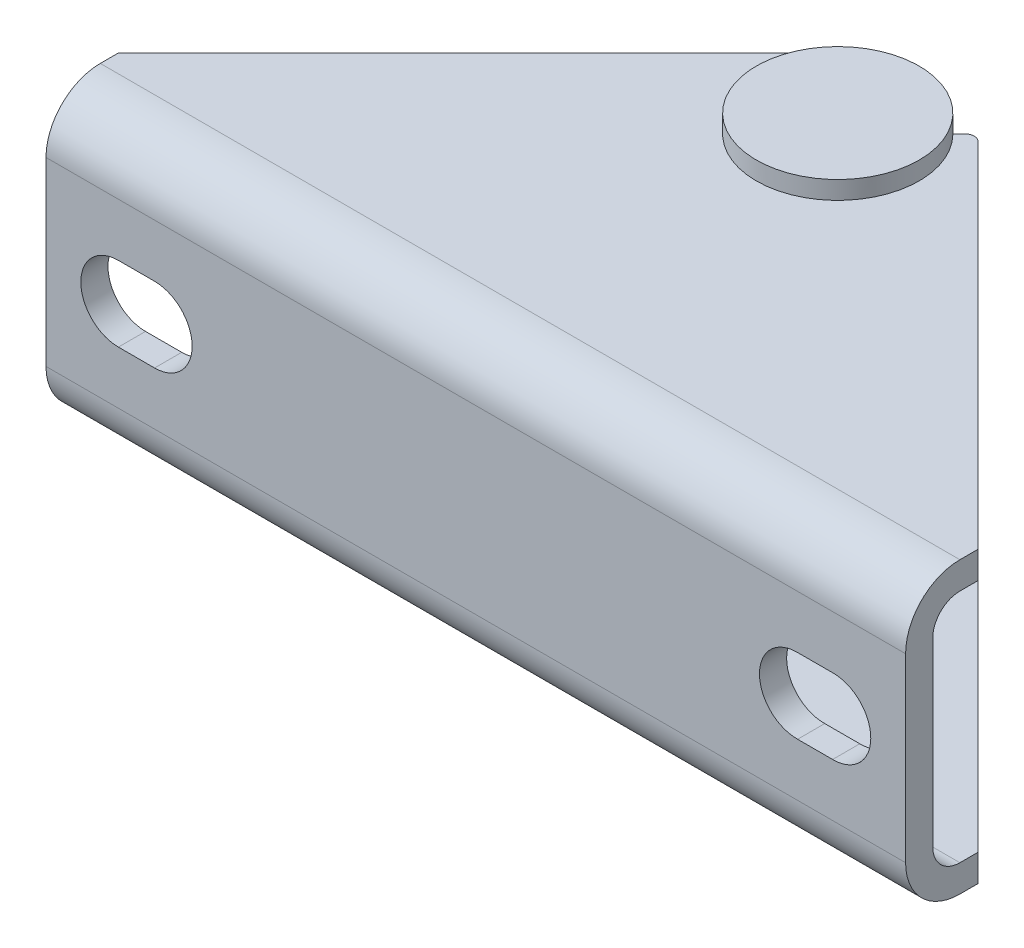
ISO-10303-21;
HEADER;
FILE_DESCRIPTION(('STEP AP214'),'2;1');
FILE_NAME('part.step','',(''),(''),'','','');
FILE_SCHEMA(('AUTOMOTIVE_DESIGN { 1 0 10303 214 1 1 1 1 }'));
ENDSEC;
DATA;
#1=APPLICATION_CONTEXT('core data for automotive mechanical design processes');
#2=APPLICATION_PROTOCOL_DEFINITION('international standard','automotive_design',2000,#1);
#3=PRODUCT_CONTEXT('',#1,'mechanical');
#4=PRODUCT('Part','Part','',(#3));
#5=PRODUCT_RELATED_PRODUCT_CATEGORY('part','',(#4));
#6=PRODUCT_DEFINITION_FORMATION('','',#4);
#7=PRODUCT_DEFINITION_CONTEXT('part definition',#1,'design');
#8=PRODUCT_DEFINITION('design','',#6,#7);
#9=PRODUCT_DEFINITION_SHAPE('','',#8);
#10=(LENGTH_UNIT() NAMED_UNIT(*) SI_UNIT(.MILLI.,.METRE.));
#11=(NAMED_UNIT(*) PLANE_ANGLE_UNIT() SI_UNIT($,.RADIAN.));
#12=(NAMED_UNIT(*) SI_UNIT($,.STERADIAN.) SOLID_ANGLE_UNIT());
#13=UNCERTAINTY_MEASURE_WITH_UNIT(LENGTH_MEASURE(1.E-05),#10,'distance_accuracy_value','');
#14=(GEOMETRIC_REPRESENTATION_CONTEXT(3) GLOBAL_UNCERTAINTY_ASSIGNED_CONTEXT((#13)) GLOBAL_UNIT_ASSIGNED_CONTEXT((#10,
#11,#12)) REPRESENTATION_CONTEXT('',''));
#15=CARTESIAN_POINT('',(0.,0.,0.));
#16=DIRECTION('',(0.,0.,1.));
#17=DIRECTION('',(1.,0.,0.));
#18=AXIS2_PLACEMENT_3D('',#15,#16,#17);
#19=CARTESIAN_POINT('',(39.5,-17.6,-40.));
#20=DIRECTION('',(0.,1.,0.));
#21=DIRECTION('',(-0.924463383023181,0.,0.381270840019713));
#22=AXIS2_PLACEMENT_3D('',#19,#20,#21);
#23=PLANE('',#22);
#24=CARTESIAN_POINT('',(39.5,-17.6,-40.));
#25=DIRECTION('',(0.,1.,0.));
#26=DIRECTION('',(-0.72903585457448,0.,0.684475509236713));
#27=AXIS2_PLACEMENT_3D('',#24,#25,#26);
#28=CIRCLE('',#27,7.);
#29=CARTESIAN_POINT('',(34.3967490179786,-17.6,-35.208671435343));
#30=VERTEX_POINT('',#29);
#31=EDGE_CURVE('E596',#30,#30,#28,.T.);
#32=ORIENTED_EDGE('',*,*,#31,.T.);
#33=EDGE_LOOP('',(#32));
#34=FACE_BOUND('',#33,.T.);
#35=CARTESIAN_POINT('',(39.5,-17.6,-40.));
#36=DIRECTION('',(0.,1.,0.));
#37=DIRECTION('',(-0.924463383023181,0.,0.381270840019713));
#38=AXIS2_PLACEMENT_3D('',#35,#36,#37);
#39=CIRCLE('',#38,7.5);
#40=CARTESIAN_POINT('',(32.5665246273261,-17.6,-37.1404686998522));
#41=VERTEX_POINT('',#40);
#42=EDGE_CURVE('E894',#41,#41,#39,.T.);
#43=ORIENTED_EDGE('',*,*,#42,.F.);
#44=EDGE_LOOP('',(#43));
#45=FACE_BOUND('',#44,.T.);
#46=ADVANCED_FACE('F15',(#34,#45),#23,.F.);
#47=CARTESIAN_POINT('',(39.5,-16.,-40.));
#48=DIRECTION('',(0.,-1.,0.));
#49=DIRECTION('',(0.924463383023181,0.,-0.381270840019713));
#50=AXIS2_PLACEMENT_3D('',#47,#48,#49);
#51=CYLINDRICAL_SURFACE('',#50,7.5);
#52=CARTESIAN_POINT('',(39.5,-16.,-40.));
#53=DIRECTION('',(0.,1.,0.));
#54=DIRECTION('',(-0.924463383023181,0.,0.381270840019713));
#55=AXIS2_PLACEMENT_3D('',#52,#53,#54);
#56=CIRCLE('',#55,7.5);
#57=CARTESIAN_POINT('',(45.5,-16.,-44.5));
#58=VERTEX_POINT('',#57);
#59=CARTESIAN_POINT('',(33.5000000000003,-16.,-44.5));
#60=VERTEX_POINT('',#59);
#61=EDGE_CURVE('E317',#58,#60,#56,.T.);
#62=ORIENTED_EDGE('',*,*,#61,.F.);
#63=EDGE_CURVE('E576',#60,#58,#56,.T.);
#64=ORIENTED_EDGE('',*,*,#63,.F.);
#65=EDGE_LOOP('',(#62,#64));
#66=FACE_BOUND('',#65,.T.);
#67=ORIENTED_EDGE('',*,*,#42,.T.);
#68=EDGE_LOOP('',(#67));
#69=FACE_BOUND('',#68,.T.);
#70=ADVANCED_FACE('F661',(#66,#69),#51,.T.);
#71=CARTESIAN_POINT('',(39.5,-16.,-40.));
#72=DIRECTION('',(0.,1.,0.));
#73=DIRECTION('',(-0.924463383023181,0.,0.381270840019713));
#74=AXIS2_PLACEMENT_3D('',#71,#72,#73);
#75=PLANE('',#74);
#76=ORIENTED_EDGE('',*,*,#61,.T.);
#77=DIRECTION('',(0.,0.,1.));
#78=VECTOR('',#77,1.);
#79=CARTESIAN_POINT('',(33.5,-16.,-40.));
#80=LINE('',#79,#78);
#81=CARTESIAN_POINT('',(33.5,-16.,-40.));
#82=VERTEX_POINT('',#81);
#83=EDGE_CURVE('E425',#60,#82,#80,.T.);
#84=ORIENTED_EDGE('',*,*,#83,.T.);
#85=CARTESIAN_POINT('',(39.5,-16.,-40.));
#86=DIRECTION('',(0.,-1.,0.));
#87=DIRECTION('',(0.99999998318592,0.,0.000183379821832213));
#88=AXIS2_PLACEMENT_3D('',#85,#86,#87);
#89=CIRCLE('',#88,6.);
#90=CARTESIAN_POINT('',(45.5,-16.,-40.));
#91=VERTEX_POINT('',#90);
#92=EDGE_CURVE('E314',#82,#91,#89,.T.);
#93=ORIENTED_EDGE('',*,*,#92,.T.);
#94=DIRECTION('',(0.,0.,-1.));
#95=VECTOR('',#94,1.);
#96=CARTESIAN_POINT('',(45.5,-16.,-40.));
#97=LINE('',#96,#95);
#98=EDGE_CURVE('E430',#91,#58,#97,.T.);
#99=ORIENTED_EDGE('',*,*,#98,.T.);
#100=EDGE_LOOP('',(#76,#84,#93,#99));
#101=FACE_BOUND('',#100,.T.);
#102=ADVANCED_FACE('F663',(#101),#75,.T.);
#103=CARTESIAN_POINT('',(47.25,-16.,-46.3357864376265));
#104=DIRECTION('',(0.,1.,0.));
#105=DIRECTION('',(1.,0.,0.));
#106=AXIS2_PLACEMENT_3D('',#103,#104,#105);
#107=PLANE('',#106);
#108=CARTESIAN_POINT('',(33.5000000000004,-16.,-46.));
#109=VERTEX_POINT('',#108);
#110=EDGE_CURVE('E426',#109,#60,#80,.T.);
#111=ORIENTED_EDGE('',*,*,#110,.T.);
#112=ORIENTED_EDGE('',*,*,#63,.T.);
#113=CARTESIAN_POINT('',(45.5,-16.,-46.));
#114=VERTEX_POINT('',#113);
#115=EDGE_CURVE('E429',#58,#114,#97,.T.);
#116=ORIENTED_EDGE('',*,*,#115,.T.);
#117=DIRECTION('',(0.707106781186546,0.,-0.707106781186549));
#118=VECTOR('',#117,1.);
#119=CARTESIAN_POINT('',(45.5,-16.,-46.));
#120=LINE('',#119,#118);
#121=CARTESIAN_POINT('',(46.5428932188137,-16.,-47.042893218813));
#122=VERTEX_POINT('',#121);
#123=EDGE_CURVE('E432',#114,#122,#120,.T.);
#124=ORIENTED_EDGE('',*,*,#123,.T.);
#125=CARTESIAN_POINT('',(47.25,-16.,-46.3357864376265));
#126=DIRECTION('',(0.,-1.,0.));
#127=DIRECTION('',(1.,0.,0.));
#128=AXIS2_PLACEMENT_3D('',#125,#126,#127);
#129=CIRCLE('',#128,1.);
#130=CARTESIAN_POINT('',(47.9571067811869,-16.,-47.042893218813));
#131=VERTEX_POINT('',#130);
#132=EDGE_CURVE('E435',#122,#131,#129,.T.);
#133=ORIENTED_EDGE('',*,*,#132,.T.);
#134=DIRECTION('',(0.707106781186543,0.,0.707106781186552));
#135=VECTOR('',#134,1.);
#136=CARTESIAN_POINT('',(87.,-16.,-7.99999999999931));
#137=LINE('',#136,#135);
#138=CARTESIAN_POINT('',(87.,-16.,-7.99999999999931));
#139=VERTEX_POINT('',#138);
#140=EDGE_CURVE('E408',#131,#139,#137,.T.);
#141=ORIENTED_EDGE('',*,*,#140,.T.);
#142=DIRECTION('',(0.,0.,1.));
#143=VECTOR('',#142,1.);
#144=CARTESIAN_POINT('',(87.,-16.,6.80011602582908E-13));
#145=LINE('',#144,#143);
#146=CARTESIAN_POINT('',(87.,-16.,-5.99999999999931));
#147=VERTEX_POINT('',#146);
#148=EDGE_CURVE('E411',#139,#147,#145,.T.);
#149=ORIENTED_EDGE('',*,*,#148,.T.);
#150=DIRECTION('',(-1.,0.,0.));
#151=VECTOR('',#150,1.);
#152=CARTESIAN_POINT('',(-8.,-16.,-6.));
#153=LINE('',#152,#151);
#154=CARTESIAN_POINT('',(-8.,-16.,-6.));
#155=VERTEX_POINT('',#154);
#156=EDGE_CURVE('E568',#147,#155,#153,.T.);
#157=ORIENTED_EDGE('',*,*,#156,.T.);
#158=DIRECTION('',(0.,0.,-1.));
#159=VECTOR('',#158,1.);
#160=CARTESIAN_POINT('',(-8.,-16.,0.));
#161=LINE('',#160,#159);
#162=CARTESIAN_POINT('',(-8.,-16.,-8.));
#163=VERTEX_POINT('',#162);
#164=EDGE_CURVE('E414',#155,#163,#161,.T.);
#165=ORIENTED_EDGE('',*,*,#164,.T.);
#166=DIRECTION('',(0.707106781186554,0.,-0.70710678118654));
#167=VECTOR('',#166,1.);
#168=CARTESIAN_POINT('',(-8.,-16.,-8.));
#169=LINE('',#168,#167);
#170=CARTESIAN_POINT('',(31.0428932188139,-16.,-47.0428932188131));
#171=VERTEX_POINT('',#170);
#172=EDGE_CURVE('E416',#163,#171,#169,.T.);
#173=ORIENTED_EDGE('',*,*,#172,.T.);
#174=CARTESIAN_POINT('',(31.7500000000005,-16.,-46.3357864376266));
#175=DIRECTION('',(0.,-1.,0.));
#176=DIRECTION('',(1.,0.,0.));
#177=AXIS2_PLACEMENT_3D('',#174,#175,#176);
#178=CIRCLE('',#177,1.);
#179=CARTESIAN_POINT('',(32.457106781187,-16.,-47.0428932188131));
#180=VERTEX_POINT('',#179);
#181=EDGE_CURVE('E419',#171,#180,#178,.T.);
#182=ORIENTED_EDGE('',*,*,#181,.T.);
#183=DIRECTION('',(0.707106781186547,0.,0.707106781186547));
#184=VECTOR('',#183,1.);
#185=CARTESIAN_POINT('',(33.5000000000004,-16.,-46.));
#186=LINE('',#185,#184);
#187=EDGE_CURVE('E422',#180,#109,#186,.T.);
#188=ORIENTED_EDGE('',*,*,#187,.T.);
#189=EDGE_LOOP('',(#111,#112,#116,#124,#133,#141,#149,#157,#165,#173,#182,#188));
#190=FACE_BOUND('',#189,.T.);
#191=ADVANCED_FACE('F637',(#190),#107,.F.);
#192=CARTESIAN_POINT('',(33.5000000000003,16.,-40.));
#193=DIRECTION('',(1.,0.,0.));
#194=DIRECTION('',(0.,0.,1.));
#195=AXIS2_PLACEMENT_3D('',#192,#193,#194);
#196=PLANE('',#195);
#197=DIRECTION('',(0.,0.,-1.));
#198=VECTOR('',#197,1.);
#199=CARTESIAN_POINT('',(33.5,-13.,-40.));
#200=LINE('',#199,#198);
#201=CARTESIAN_POINT('',(33.5,-13.,-40.));
#202=VERTEX_POINT('',#201);
#203=CARTESIAN_POINT('',(33.5000000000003,-13.,-41.75));
#204=VERTEX_POINT('',#203);
#205=EDGE_CURVE('E394',#202,#204,#200,.T.);
#206=ORIENTED_EDGE('',*,*,#205,.F.);
#207=DIRECTION('',(0.,-1.,0.));
#208=VECTOR('',#207,1.);
#209=CARTESIAN_POINT('',(33.5000000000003,16.,-40.));
#210=LINE('',#209,#208);
#211=EDGE_CURVE('E485',#202,#82,#210,.T.);
#212=ORIENTED_EDGE('',*,*,#211,.T.);
#213=ORIENTED_EDGE('',*,*,#83,.F.);
#214=ORIENTED_EDGE('',*,*,#110,.F.);
#215=DIRECTION('',(0.,-1.,0.));
#216=VECTOR('',#215,1.);
#217=CARTESIAN_POINT('',(33.5000000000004,16.,-46.));
#218=LINE('',#217,#216);
#219=CARTESIAN_POINT('',(33.5000000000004,-13.,-46.));
#220=VERTEX_POINT('',#219);
#221=EDGE_CURVE('E489',#220,#109,#218,.T.);
#222=ORIENTED_EDGE('',*,*,#221,.F.);
#223=EDGE_CURVE('E40',#204,#220,#200,.T.);
#224=ORIENTED_EDGE('',*,*,#223,.F.);
#225=EDGE_LOOP('',(#206,#212,#213,#214,#222,#224));
#226=FACE_BOUND('',#225,.T.);
#227=ADVANCED_FACE('F680',(#226),#196,.T.);
#228=CARTESIAN_POINT('',(39.5,-16.,-40.));
#229=DIRECTION('',(0.,1.,0.));
#230=DIRECTION('',(-0.99999998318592,0.,-0.000183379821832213));
#231=AXIS2_PLACEMENT_3D('',#228,#229,#230);
#232=CYLINDRICAL_SURFACE('',#231,6.);
#233=CARTESIAN_POINT('',(39.5,16.,-40.));
#234=DIRECTION('',(0.,-1.,0.));
#235=DIRECTION('',(0.99999998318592,0.,0.000183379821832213));
#236=AXIS2_PLACEMENT_3D('',#233,#234,#235);
#237=CIRCLE('',#236,6.);
#238=CARTESIAN_POINT('',(45.5,16.,-40.));
#239=VERTEX_POINT('',#238);
#240=CARTESIAN_POINT('',(33.5000000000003,16.,-40.));
#241=VERTEX_POINT('',#240);
#242=EDGE_CURVE('E868',#239,#241,#237,.F.);
#243=ORIENTED_EDGE('',*,*,#242,.F.);
#244=DIRECTION('',(0.,-1.,0.));
#245=VECTOR('',#244,1.);
#246=CARTESIAN_POINT('',(45.5,16.,-40.));
#247=LINE('',#246,#245);
#248=CARTESIAN_POINT('',(45.5,13.,-40.));
#249=VERTEX_POINT('',#248);
#250=EDGE_CURVE('E480',#239,#249,#247,.T.);
#251=ORIENTED_EDGE('',*,*,#250,.T.);
#252=CARTESIAN_POINT('',(39.5,13.,-40.));
#253=DIRECTION('',(0.,1.,0.));
#254=DIRECTION('',(1.,0.,0.));
#255=AXIS2_PLACEMENT_3D('',#252,#253,#254);
#256=CIRCLE('',#255,6.);
#257=CARTESIAN_POINT('',(33.5,13.,-40.));
#258=VERTEX_POINT('',#257);
#259=EDGE_CURVE('E364',#258,#249,#256,.T.);
#260=ORIENTED_EDGE('',*,*,#259,.F.);
#261=EDGE_CURVE('E483',#241,#258,#210,.T.);
#262=ORIENTED_EDGE('',*,*,#261,.F.);
#263=EDGE_LOOP('',(#243,#251,#260,#262));
#264=FACE_BOUND('',#263,.T.);
#265=CARTESIAN_POINT('',(39.5,-13.,-40.));
#266=DIRECTION('',(0.,-1.,0.));
#267=DIRECTION('',(-1.,0.,0.));
#268=AXIS2_PLACEMENT_3D('',#265,#266,#267);
#269=CIRCLE('',#268,6.);
#270=CARTESIAN_POINT('',(45.5,-13.,-40.));
#271=VERTEX_POINT('',#270);
#272=EDGE_CURVE('E391',#271,#202,#269,.T.);
#273=ORIENTED_EDGE('',*,*,#272,.F.);
#274=EDGE_CURVE('E482',#271,#91,#247,.T.);
#275=ORIENTED_EDGE('',*,*,#274,.T.);
#276=ORIENTED_EDGE('',*,*,#92,.F.);
#277=ORIENTED_EDGE('',*,*,#211,.F.);
#278=EDGE_LOOP('',(#273,#275,#276,#277));
#279=FACE_BOUND('',#278,.T.);
#280=ADVANCED_FACE('F670',(#264,#279),#232,.T.);
#281=CARTESIAN_POINT('',(45.5,16.,-40.));
#282=DIRECTION('',(-1.,0.,0.));
#283=DIRECTION('',(0.,0.,-1.));
#284=AXIS2_PLACEMENT_3D('',#281,#282,#283);
#285=PLANE('',#284);
#286=DIRECTION('',(0.,0.,1.));
#287=VECTOR('',#286,1.);
#288=CARTESIAN_POINT('',(45.5,-13.,-40.));
#289=LINE('',#288,#287);
#290=CARTESIAN_POINT('',(45.5,-13.,-46.));
#291=VERTEX_POINT('',#290);
#292=CARTESIAN_POINT('',(45.5,-13.,-41.75));
#293=VERTEX_POINT('',#292);
#294=EDGE_CURVE('E32',#291,#293,#289,.T.);
#295=ORIENTED_EDGE('',*,*,#294,.F.);
#296=DIRECTION('',(0.,-1.,0.));
#297=VECTOR('',#296,1.);
#298=CARTESIAN_POINT('',(45.5,16.,-46.));
#299=LINE('',#298,#297);
#300=EDGE_CURVE('E479',#291,#114,#299,.T.);
#301=ORIENTED_EDGE('',*,*,#300,.T.);
#302=ORIENTED_EDGE('',*,*,#115,.F.);
#303=ORIENTED_EDGE('',*,*,#98,.F.);
#304=ORIENTED_EDGE('',*,*,#274,.F.);
#305=EDGE_CURVE('E388',#293,#271,#289,.T.);
#306=ORIENTED_EDGE('',*,*,#305,.F.);
#307=EDGE_LOOP('',(#295,#301,#302,#303,#304,#306));
#308=FACE_BOUND('',#307,.T.);
#309=ADVANCED_FACE('F767',(#308),#285,.T.);
#310=CARTESIAN_POINT('',(45.5,16.,-46.));
#311=DIRECTION('',(-0.707106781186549,0.,-0.707106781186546));
#312=DIRECTION('',(0.707106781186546,0.,-0.707106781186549));
#313=AXIS2_PLACEMENT_3D('',#310,#311,#312);
#314=PLANE('',#313);
#315=DIRECTION('',(-0.707106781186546,0.,0.707106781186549));
#316=VECTOR('',#315,1.);
#317=CARTESIAN_POINT('',(45.5,-13.,-46.));
#318=LINE('',#317,#316);
#319=CARTESIAN_POINT('',(46.5428932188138,-13.,-47.042893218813));
#320=VERTEX_POINT('',#319);
#321=CARTESIAN_POINT('',(46.2175144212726,-13.,-46.7175144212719));
#322=VERTEX_POINT('',#321);
#323=EDGE_CURVE('E385',#320,#322,#318,.T.);
#324=ORIENTED_EDGE('',*,*,#323,.F.);
#325=DIRECTION('',(0.,-1.,0.));
#326=VECTOR('',#325,1.);
#327=CARTESIAN_POINT('',(46.5428932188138,16.,-47.042893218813));
#328=LINE('',#327,#326);
#329=EDGE_CURVE('E475',#320,#122,#328,.T.);
#330=ORIENTED_EDGE('',*,*,#329,.T.);
#331=ORIENTED_EDGE('',*,*,#123,.F.);
#332=ORIENTED_EDGE('',*,*,#300,.F.);
#333=EDGE_CURVE('E389',#322,#291,#318,.T.);
#334=ORIENTED_EDGE('',*,*,#333,.F.);
#335=EDGE_LOOP('',(#324,#330,#331,#332,#334));
#336=FACE_BOUND('',#335,.T.);
#337=ADVANCED_FACE('F762',(#336),#314,.T.);
#338=CARTESIAN_POINT('',(47.25,16.,-46.3357864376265));
#339=DIRECTION('',(0.,-1.,0.));
#340=DIRECTION('',(-1.,0.,0.));
#341=AXIS2_PLACEMENT_3D('',#338,#339,#340);
#342=CYLINDRICAL_SURFACE('',#341,1.);
#343=CARTESIAN_POINT('',(47.25,-13.,-46.3357864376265));
#344=DIRECTION('',(0.,-1.,0.));
#345=DIRECTION('',(-1.,0.,0.));
#346=AXIS2_PLACEMENT_3D('',#343,#344,#345);
#347=CIRCLE('',#346,1.);
#348=CARTESIAN_POINT('',(47.9571067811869,-13.,-47.042893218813));
#349=VERTEX_POINT('',#348);
#350=EDGE_CURVE('E383',#349,#320,#347,.F.);
#351=ORIENTED_EDGE('',*,*,#350,.F.);
#352=DIRECTION('',(0.,-1.,0.));
#353=VECTOR('',#352,1.);
#354=CARTESIAN_POINT('',(47.9571067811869,16.,-47.042893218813));
#355=LINE('',#354,#353);
#356=EDGE_CURVE('E471',#349,#131,#355,.T.);
#357=ORIENTED_EDGE('',*,*,#356,.T.);
#358=ORIENTED_EDGE('',*,*,#132,.F.);
#359=ORIENTED_EDGE('',*,*,#329,.F.);
#360=EDGE_LOOP('',(#351,#357,#358,#359));
#361=FACE_BOUND('',#360,.T.);
#362=ADVANCED_FACE('F756',(#361),#342,.T.);
#363=CARTESIAN_POINT('',(87.,16.,-7.99999999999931));
#364=DIRECTION('',(0.707106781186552,0.,-0.707106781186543));
#365=DIRECTION('',(0.707106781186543,0.,0.707106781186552));
#366=AXIS2_PLACEMENT_3D('',#363,#364,#365);
#367=PLANE('',#366);
#368=DIRECTION('',(-0.707106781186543,0.,-0.707106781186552));
#369=VECTOR('',#368,1.);
#370=CARTESIAN_POINT('',(87.,-13.,-7.99999999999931));
#371=LINE('',#370,#369);
#372=CARTESIAN_POINT('',(87.,-13.,-7.99999999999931));
#373=VERTEX_POINT('',#372);
#374=EDGE_CURVE('E381',#373,#349,#371,.T.);
#375=ORIENTED_EDGE('',*,*,#374,.F.);
#376=DIRECTION('',(0.,-1.,0.));
#377=VECTOR('',#376,1.);
#378=CARTESIAN_POINT('',(87.,16.,-7.99999999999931));
#379=LINE('',#378,#377);
#380=EDGE_CURVE('E466',#373,#139,#379,.T.);
#381=ORIENTED_EDGE('',*,*,#380,.T.);
#382=ORIENTED_EDGE('',*,*,#140,.F.);
#383=ORIENTED_EDGE('',*,*,#356,.F.);
#384=EDGE_LOOP('',(#375,#381,#382,#383));
#385=FACE_BOUND('',#384,.T.);
#386=ADVANCED_FACE('F703',(#385),#367,.T.);
#387=CARTESIAN_POINT('',(87.,16.,6.80011602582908E-13));
#388=DIRECTION('',(1.,0.,0.));
#389=DIRECTION('',(0.,-1.,0.));
#390=AXIS2_PLACEMENT_3D('',#387,#388,#389);
#391=PLANE('',#390);
#392=DIRECTION('',(0.,0.,1.));
#393=VECTOR('',#392,1.);
#394=CARTESIAN_POINT('',(87.,16.,6.80011602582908E-13));
#395=LINE('',#394,#393);
#396=CARTESIAN_POINT('',(87.,16.,-7.99999999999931));
#397=VERTEX_POINT('',#396);
#398=CARTESIAN_POINT('',(87.,16.,-5.99999999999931));
#399=VERTEX_POINT('',#398);
#400=EDGE_CURVE('E441',#397,#399,#395,.T.);
#401=ORIENTED_EDGE('',*,*,#400,.T.);
#402=CARTESIAN_POINT('',(87.,10.,-5.99999999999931));
#403=DIRECTION('',(1.,0.,0.));
#404=DIRECTION('',(0.,-1.,0.));
#405=AXIS2_PLACEMENT_3D('',#402,#403,#404);
#406=CIRCLE('',#405,6.);
#407=CARTESIAN_POINT('',(87.,10.,6.80011602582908E-13));
#408=VERTEX_POINT('',#407);
#409=EDGE_CURVE('E566',#399,#408,#406,.T.);
#410=ORIENTED_EDGE('',*,*,#409,.T.);
#411=DIRECTION('',(0.,-1.,0.));
#412=VECTOR('',#411,1.);
#413=CARTESIAN_POINT('',(87.,16.,6.80011602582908E-13));
#414=LINE('',#413,#412);
#415=CARTESIAN_POINT('',(87.,-10.,6.80011602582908E-13));
#416=VERTEX_POINT('',#415);
#417=EDGE_CURVE('E505',#408,#416,#414,.T.);
#418=ORIENTED_EDGE('',*,*,#417,.T.);
#419=CARTESIAN_POINT('',(87.,-10.,-5.99999999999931));
#420=DIRECTION('',(1.,0.,0.));
#421=DIRECTION('',(0.,-1.,0.));
#422=AXIS2_PLACEMENT_3D('',#419,#420,#421);
#423=CIRCLE('',#422,6.);
#424=EDGE_CURVE('E564',#416,#147,#423,.T.);
#425=ORIENTED_EDGE('',*,*,#424,.T.);
#426=ORIENTED_EDGE('',*,*,#148,.F.);
#427=ORIENTED_EDGE('',*,*,#380,.F.);
#428=DIRECTION('',(0.,0.,-1.));
#429=VECTOR('',#428,1.);
#430=CARTESIAN_POINT('',(87.,-13.,6.80011602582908E-13));
#431=LINE('',#430,#429);
#432=CARTESIAN_POINT('',(87.,-13.,-5.99999999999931));
#433=VERTEX_POINT('',#432);
#434=EDGE_CURVE('E516',#433,#373,#431,.T.);
#435=ORIENTED_EDGE('',*,*,#434,.F.);
#436=CARTESIAN_POINT('',(87.,-10.,-5.99999999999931));
#437=DIRECTION('',(1.,0.,0.));
#438=DIRECTION('',(0.,-1.,0.));
#439=AXIS2_PLACEMENT_3D('',#436,#437,#438);
#440=CIRCLE('',#439,3.);
#441=CARTESIAN_POINT('',(87.,-10.,-2.9999999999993));
#442=VERTEX_POINT('',#441);
#443=EDGE_CURVE('E551',#433,#442,#440,.F.);
#444=ORIENTED_EDGE('',*,*,#443,.T.);
#445=DIRECTION('',(0.,-1.,0.));
#446=VECTOR('',#445,1.);
#447=CARTESIAN_POINT('',(87.,16.,-2.9999999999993));
#448=LINE('',#447,#446);
#449=CARTESIAN_POINT('',(87.,10.,-2.9999999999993));
#450=VERTEX_POINT('',#449);
#451=EDGE_CURVE('E470',#450,#442,#448,.T.);
#452=ORIENTED_EDGE('',*,*,#451,.F.);
#453=CARTESIAN_POINT('',(87.,10.,-5.99999999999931));
#454=DIRECTION('',(1.,0.,0.));
#455=DIRECTION('',(0.,-1.,0.));
#456=AXIS2_PLACEMENT_3D('',#453,#454,#455);
#457=CIRCLE('',#456,3.);
#458=CARTESIAN_POINT('',(87.,13.,-5.99999999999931));
#459=VERTEX_POINT('',#458);
#460=EDGE_CURVE('E547',#450,#459,#457,.F.);
#461=ORIENTED_EDGE('',*,*,#460,.T.);
#462=DIRECTION('',(0.,0.,1.));
#463=VECTOR('',#462,1.);
#464=CARTESIAN_POINT('',(87.,13.,6.80011602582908E-13));
#465=LINE('',#464,#463);
#466=CARTESIAN_POINT('',(87.,13.,-7.99999999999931));
#467=VERTEX_POINT('',#466);
#468=EDGE_CURVE('E513',#467,#459,#465,.T.);
#469=ORIENTED_EDGE('',*,*,#468,.F.);
#470=EDGE_CURVE('E508',#397,#467,#379,.T.);
#471=ORIENTED_EDGE('',*,*,#470,.F.);
#472=EDGE_LOOP('',(#401,#410,#418,#425,#426,#427,#435,#444,#452,#461,#469,#471));
#473=FACE_BOUND('',#472,.T.);
#474=ADVANCED_FACE('F690',(#473),#391,.T.);
#475=CARTESIAN_POINT('',(47.25,-10.,-5.99999999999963));
#476=DIRECTION('',(1.,0.,0.));
#477=DIRECTION('',(0.,-1.,0.));
#478=AXIS2_PLACEMENT_3D('',#475,#476,#477);
#479=CYLINDRICAL_SURFACE('',#478,6.);
#480=ORIENTED_EDGE('',*,*,#424,.F.);
#481=DIRECTION('',(-1.,0.,0.));
#482=VECTOR('',#481,1.);
#483=CARTESIAN_POINT('',(87.,-10.,6.80011602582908E-13));
#484=LINE('',#483,#482);
#485=CARTESIAN_POINT('',(-8.,-10.,0.));
#486=VERTEX_POINT('',#485);
#487=EDGE_CURVE('E553',#486,#416,#484,.F.);
#488=ORIENTED_EDGE('',*,*,#487,.F.);
#489=CARTESIAN_POINT('',(-8.,-10.,-6.));
#490=DIRECTION('',(-1.,0.,0.));
#491=DIRECTION('',(0.,1.,0.));
#492=AXIS2_PLACEMENT_3D('',#489,#490,#491);
#493=CIRCLE('',#492,6.);
#494=EDGE_CURVE('E558',#155,#486,#493,.T.);
#495=ORIENTED_EDGE('',*,*,#494,.F.);
#496=ORIENTED_EDGE('',*,*,#156,.F.);
#497=EDGE_LOOP('',(#480,#488,#495,#496));
#498=FACE_BOUND('',#497,.T.);
#499=ADVANCED_FACE('F686',(#498),#479,.T.);
#500=CARTESIAN_POINT('',(-8.,16.,0.));
#501=DIRECTION('',(-1.,0.,0.));
#502=DIRECTION('',(0.,1.,0.));
#503=AXIS2_PLACEMENT_3D('',#500,#501,#502);
#504=PLANE('',#503);
#505=DIRECTION('',(0.,-1.,0.));
#506=VECTOR('',#505,1.);
#507=CARTESIAN_POINT('',(-8.,16.,0.));
#508=LINE('',#507,#506);
#509=CARTESIAN_POINT('',(-8.,10.,0.));
#510=VERTEX_POINT('',#509);
#511=EDGE_CURVE('E502',#510,#486,#508,.T.);
#512=ORIENTED_EDGE('',*,*,#511,.F.);
#513=CARTESIAN_POINT('',(-8.,10.,-6.));
#514=DIRECTION('',(-1.,0.,0.));
#515=DIRECTION('',(0.,1.,0.));
#516=AXIS2_PLACEMENT_3D('',#513,#514,#515);
#517=CIRCLE('',#516,6.);
#518=CARTESIAN_POINT('',(-8.,16.,-6.));
#519=VERTEX_POINT('',#518);
#520=EDGE_CURVE('E560',#510,#519,#517,.T.);
#521=ORIENTED_EDGE('',*,*,#520,.T.);
#522=DIRECTION('',(0.,0.,-1.));
#523=VECTOR('',#522,1.);
#524=CARTESIAN_POINT('',(-8.,16.,0.));
#525=LINE('',#524,#523);
#526=CARTESIAN_POINT('',(-7.99999999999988,16.,-8.));
#527=VERTEX_POINT('',#526);
#528=EDGE_CURVE('E444',#519,#527,#525,.T.);
#529=ORIENTED_EDGE('',*,*,#528,.T.);
#530=DIRECTION('',(0.,-1.,0.));
#531=VECTOR('',#530,1.);
#532=CARTESIAN_POINT('',(-7.99999999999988,16.,-8.));
#533=LINE('',#532,#531);
#534=CARTESIAN_POINT('',(-7.99999999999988,13.,-8.));
#535=VERTEX_POINT('',#534);
#536=EDGE_CURVE('E498',#527,#535,#533,.T.);
#537=ORIENTED_EDGE('',*,*,#536,.T.);
#538=DIRECTION('',(0.,0.,-1.));
#539=VECTOR('',#538,1.);
#540=CARTESIAN_POINT('',(-8.,13.,0.));
#541=LINE('',#540,#539);
#542=CARTESIAN_POINT('',(-8.,13.,-6.));
#543=VERTEX_POINT('',#542);
#544=EDGE_CURVE('E379',#543,#535,#541,.T.);
#545=ORIENTED_EDGE('',*,*,#544,.F.);
#546=CARTESIAN_POINT('',(-8.,10.,-6.));
#547=DIRECTION('',(-1.,0.,0.));
#548=DIRECTION('',(0.,1.,0.));
#549=AXIS2_PLACEMENT_3D('',#546,#547,#548);
#550=CIRCLE('',#549,3.);
#551=CARTESIAN_POINT('',(-8.,10.,-3.00000000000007));
#552=VERTEX_POINT('',#551);
#553=EDGE_CURVE('E545',#543,#552,#550,.F.);
#554=ORIENTED_EDGE('',*,*,#553,.T.);
#555=DIRECTION('',(0.,1.,0.));
#556=VECTOR('',#555,1.);
#557=CARTESIAN_POINT('',(-8.,16.,-3.00000000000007));
#558=LINE('',#557,#556);
#559=CARTESIAN_POINT('',(-8.,-10.,-3.00000000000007));
#560=VERTEX_POINT('',#559);
#561=EDGE_CURVE('E349',#560,#552,#558,.T.);
#562=ORIENTED_EDGE('',*,*,#561,.F.);
#563=CARTESIAN_POINT('',(-8.,-10.,-6.));
#564=DIRECTION('',(-1.,0.,0.));
#565=DIRECTION('',(0.,1.,0.));
#566=AXIS2_PLACEMENT_3D('',#563,#564,#565);
#567=CIRCLE('',#566,3.);
#568=CARTESIAN_POINT('',(-8.,-13.,-6.));
#569=VERTEX_POINT('',#568);
#570=EDGE_CURVE('E549',#560,#569,#567,.F.);
#571=ORIENTED_EDGE('',*,*,#570,.T.);
#572=DIRECTION('',(0.,0.,1.));
#573=VECTOR('',#572,1.);
#574=CARTESIAN_POINT('',(-8.,-13.,0.));
#575=LINE('',#574,#573);
#576=CARTESIAN_POINT('',(-8.,-13.,-8.));
#577=VERTEX_POINT('',#576);
#578=EDGE_CURVE('E405',#577,#569,#575,.T.);
#579=ORIENTED_EDGE('',*,*,#578,.F.);
#580=EDGE_CURVE('E501',#577,#163,#533,.T.);
#581=ORIENTED_EDGE('',*,*,#580,.T.);
#582=ORIENTED_EDGE('',*,*,#164,.F.);
#583=ORIENTED_EDGE('',*,*,#494,.T.);
#584=EDGE_LOOP('',(#512,#521,#529,#537,#545,#554,#562,#571,#579,#581,#582,#583));
#585=FACE_BOUND('',#584,.T.);
#586=ADVANCED_FACE('F689',(#585),#504,.T.);
#587=CARTESIAN_POINT('',(-7.99999999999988,16.,-8.));
#588=DIRECTION('',(-0.70710678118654,0.,-0.707106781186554));
#589=DIRECTION('',(0.707106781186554,0.,-0.70710678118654));
#590=AXIS2_PLACEMENT_3D('',#587,#588,#589);
#591=PLANE('',#590);
#592=DIRECTION('',(-0.707106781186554,0.,0.70710678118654));
#593=VECTOR('',#592,1.);
#594=CARTESIAN_POINT('',(-8.,-13.,-8.));
#595=LINE('',#594,#593);
#596=CARTESIAN_POINT('',(31.0428932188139,-13.,-47.0428932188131));
#597=VERTEX_POINT('',#596);
#598=EDGE_CURVE('E403',#597,#577,#595,.T.);
#599=ORIENTED_EDGE('',*,*,#598,.F.);
#600=DIRECTION('',(0.,-1.,0.));
#601=VECTOR('',#600,1.);
#602=CARTESIAN_POINT('',(31.0428932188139,16.,-47.0428932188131));
#603=LINE('',#602,#601);
#604=EDGE_CURVE('E497',#597,#171,#603,.T.);
#605=ORIENTED_EDGE('',*,*,#604,.T.);
#606=ORIENTED_EDGE('',*,*,#172,.F.);
#607=ORIENTED_EDGE('',*,*,#580,.F.);
#608=EDGE_LOOP('',(#599,#605,#606,#607));
#609=FACE_BOUND('',#608,.T.);
#610=ADVANCED_FACE('F693',(#609),#591,.T.);
#611=CARTESIAN_POINT('',(31.7500000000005,16.,-46.3357864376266));
#612=DIRECTION('',(0.,-1.,0.));
#613=DIRECTION('',(-1.,0.,0.));
#614=AXIS2_PLACEMENT_3D('',#611,#612,#613);
#615=CYLINDRICAL_SURFACE('',#614,1.);
#616=CARTESIAN_POINT('',(31.7500000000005,-13.,-46.3357864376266));
#617=DIRECTION('',(0.,-1.,0.));
#618=DIRECTION('',(-1.,0.,0.));
#619=AXIS2_PLACEMENT_3D('',#616,#617,#618);
#620=CIRCLE('',#619,1.);
#621=CARTESIAN_POINT('',(32.457106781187,-13.,-47.0428932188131));
#622=VERTEX_POINT('',#621);
#623=EDGE_CURVE('E401',#622,#597,#620,.F.);
#624=ORIENTED_EDGE('',*,*,#623,.F.);
#625=DIRECTION('',(0.,-1.,0.));
#626=VECTOR('',#625,1.);
#627=CARTESIAN_POINT('',(32.457106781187,16.,-47.0428932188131));
#628=LINE('',#627,#626);
#629=EDGE_CURVE('E493',#622,#180,#628,.T.);
#630=ORIENTED_EDGE('',*,*,#629,.T.);
#631=ORIENTED_EDGE('',*,*,#181,.F.);
#632=ORIENTED_EDGE('',*,*,#604,.F.);
#633=EDGE_LOOP('',(#624,#630,#631,#632));
#634=FACE_BOUND('',#633,.T.);
#635=ADVANCED_FACE('F774',(#634),#615,.T.);
#636=CARTESIAN_POINT('',(33.5000000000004,16.,-46.));
#637=DIRECTION('',(0.707106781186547,0.,-0.707106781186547));
#638=DIRECTION('',(0.707106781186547,0.,0.707106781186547));
#639=AXIS2_PLACEMENT_3D('',#636,#637,#638);
#640=PLANE('',#639);
#641=DIRECTION('',(-0.707106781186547,0.,-0.707106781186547));
#642=VECTOR('',#641,1.);
#643=CARTESIAN_POINT('',(33.5000000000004,-13.,-46.));
#644=LINE('',#643,#642);
#645=CARTESIAN_POINT('',(32.7824855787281,-13.,-46.7175144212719));
#646=VERTEX_POINT('',#645);
#647=EDGE_CURVE('E398',#220,#646,#644,.T.);
#648=ORIENTED_EDGE('',*,*,#647,.F.);
#649=ORIENTED_EDGE('',*,*,#221,.T.);
#650=ORIENTED_EDGE('',*,*,#187,.F.);
#651=ORIENTED_EDGE('',*,*,#629,.F.);
#652=EDGE_CURVE('E397',#646,#622,#644,.T.);
#653=ORIENTED_EDGE('',*,*,#652,.F.);
#654=EDGE_LOOP('',(#648,#649,#650,#651,#653));
#655=FACE_BOUND('',#654,.T.);
#656=ADVANCED_FACE('F641',(#655),#640,.T.);
#657=CARTESIAN_POINT('',(89.5,-13.,-50.4687676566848));
#658=DIRECTION('',(0.,-1.,0.));
#659=DIRECTION('',(-1.,0.,0.));
#660=AXIS2_PLACEMENT_3D('',#657,#658,#659);
#661=PLANE('',#660);
#662=CARTESIAN_POINT('',(39.5,-13.,-40.));
#663=DIRECTION('',(0.,-1.,0.));
#664=DIRECTION('',(0.963329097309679,0.,0.268322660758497));
#665=AXIS2_PLACEMENT_3D('',#662,#663,#664);
#666=CIRCLE('',#665,6.25);
#667=EDGE_CURVE('E580',#293,#204,#666,.T.);
#668=ORIENTED_EDGE('',*,*,#667,.F.);
#669=ORIENTED_EDGE('',*,*,#305,.T.);
#670=ORIENTED_EDGE('',*,*,#272,.T.);
#671=ORIENTED_EDGE('',*,*,#205,.T.);
#672=EDGE_LOOP('',(#668,#669,#670,#671));
#673=FACE_BOUND('',#672,.T.);
#674=ADVANCED_FACE('F683',(#673),#661,.F.);
#675=CARTESIAN_POINT('',(39.5,-13.,-40.));
#676=DIRECTION('',(0.,-1.,0.));
#677=DIRECTION('',(0.963329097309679,0.,0.268322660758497));
#678=AXIS2_PLACEMENT_3D('',#675,#676,#677);
#679=PLANE('',#678);
#680=CARTESIAN_POINT('',(39.5,-13.,-40.));
#681=DIRECTION('',(0.,-1.,0.));
#682=DIRECTION('',(0.963329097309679,0.,0.268322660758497));
#683=AXIS2_PLACEMENT_3D('',#680,#681,#682);
#684=CIRCLE('',#683,9.5);
#685=EDGE_CURVE('E400',#646,#322,#684,.T.);
#686=ORIENTED_EDGE('',*,*,#685,.T.);
#687=ORIENTED_EDGE('',*,*,#333,.T.);
#688=ORIENTED_EDGE('',*,*,#294,.T.);
#689=EDGE_CURVE('E582',#204,#293,#666,.T.);
#690=ORIENTED_EDGE('',*,*,#689,.F.);
#691=ORIENTED_EDGE('',*,*,#223,.T.);
#692=ORIENTED_EDGE('',*,*,#647,.T.);
#693=EDGE_LOOP('',(#686,#687,#688,#690,#691,#692));
#694=FACE_BOUND('',#693,.T.);
#695=ADVANCED_FACE('F657',(#694),#679,.T.);
#696=CARTESIAN_POINT('',(39.5,16.,-40.));
#697=DIRECTION('',(0.,-1.,0.));
#698=DIRECTION('',(0.99999998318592,0.,0.000183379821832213));
#699=AXIS2_PLACEMENT_3D('',#696,#697,#698);
#700=PLANE('',#699);
#701=DIRECTION('',(0.707106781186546,0.,-0.707106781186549));
#702=VECTOR('',#701,1.);
#703=CARTESIAN_POINT('',(45.5,16.,-46.));
#704=LINE('',#703,#702);
#705=CARTESIAN_POINT('',(45.5,16.,-46.));
#706=VERTEX_POINT('',#705);
#707=CARTESIAN_POINT('',(45.8639610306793,16.,-46.3639610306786));
#708=VERTEX_POINT('',#707);
#709=EDGE_CURVE('E461',#706,#708,#704,.T.);
#710=ORIENTED_EDGE('',*,*,#709,.F.);
#711=DIRECTION('',(0.,0.,-1.));
#712=VECTOR('',#711,1.);
#713=CARTESIAN_POINT('',(45.5,16.,-40.));
#714=LINE('',#713,#712);
#715=EDGE_CURVE('E458',#239,#706,#714,.T.);
#716=ORIENTED_EDGE('',*,*,#715,.F.);
#717=ORIENTED_EDGE('',*,*,#242,.T.);
#718=DIRECTION('',(0.,0.,1.));
#719=VECTOR('',#718,1.);
#720=CARTESIAN_POINT('',(33.5000000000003,16.,-40.));
#721=LINE('',#720,#719);
#722=CARTESIAN_POINT('',(33.5000000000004,16.,-46.));
#723=VERTEX_POINT('',#722);
#724=EDGE_CURVE('E456',#723,#241,#721,.T.);
#725=ORIENTED_EDGE('',*,*,#724,.F.);
#726=DIRECTION('',(0.707106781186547,0.,0.707106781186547));
#727=VECTOR('',#726,1.);
#728=CARTESIAN_POINT('',(33.5000000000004,16.,-46.));
#729=LINE('',#728,#727);
#730=CARTESIAN_POINT('',(33.1360389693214,16.,-46.3639610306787));
#731=VERTEX_POINT('',#730);
#732=EDGE_CURVE('E452',#731,#723,#729,.T.);
#733=ORIENTED_EDGE('',*,*,#732,.F.);
#734=CARTESIAN_POINT('',(39.5,16.,-40.));
#735=DIRECTION('',(0.,-1.,0.));
#736=DIRECTION('',(0.99999998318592,0.,0.000183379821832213));
#737=AXIS2_PLACEMENT_3D('',#734,#735,#736);
#738=CIRCLE('',#737,9.);
#739=EDGE_CURVE('E879',#731,#708,#738,.T.);
#740=ORIENTED_EDGE('',*,*,#739,.T.);
#741=EDGE_LOOP('',(#710,#716,#717,#725,#733,#740));
#742=FACE_BOUND('',#741,.T.);
#743=ADVANCED_FACE('F765',(#742),#700,.T.);
#744=DIRECTION('',(0.,0.,-1.));
#745=VECTOR('',#744,1.);
#746=CARTESIAN_POINT('',(45.5,13.,-40.));
#747=LINE('',#746,#745);
#748=CARTESIAN_POINT('',(45.5,13.,-41.75));
#749=VERTEX_POINT('',#748);
#750=EDGE_CURVE('E361',#249,#749,#747,.T.);
#751=ORIENTED_EDGE('',*,*,#750,.F.);
#752=ORIENTED_EDGE('',*,*,#250,.F.);
#753=ORIENTED_EDGE('',*,*,#715,.T.);
#754=CARTESIAN_POINT('',(45.5,13.,-46.));
#755=VERTEX_POINT('',#754);
#756=EDGE_CURVE('E476',#706,#755,#299,.T.);
#757=ORIENTED_EDGE('',*,*,#756,.T.);
#758=EDGE_CURVE('E360',#749,#755,#747,.T.);
#759=ORIENTED_EDGE('',*,*,#758,.F.);
#760=EDGE_LOOP('',(#751,#752,#753,#757,#759));
#761=FACE_BOUND('',#760,.T.);
#762=ADVANCED_FACE('F742',(#761),#285,.T.);
#763=CARTESIAN_POINT('',(89.5,13.,-50.4687676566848));
#764=DIRECTION('',(0.,1.,0.));
#765=DIRECTION('',(1.,0.,0.));
#766=AXIS2_PLACEMENT_3D('',#763,#764,#765);
#767=PLANE('',#766);
#768=ORIENTED_EDGE('',*,*,#750,.T.);
#769=CARTESIAN_POINT('',(39.5,13.,-40.));
#770=DIRECTION('',(0.,1.,0.));
#771=DIRECTION('',(-0.99999998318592,0.,-0.000183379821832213));
#772=AXIS2_PLACEMENT_3D('',#769,#770,#771);
#773=CIRCLE('',#772,6.25);
#774=CARTESIAN_POINT('',(33.5000000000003,13.,-41.75));
#775=VERTEX_POINT('',#774);
#776=EDGE_CURVE('E571',#749,#775,#773,.F.);
#777=ORIENTED_EDGE('',*,*,#776,.T.);
#778=DIRECTION('',(0.,0.,1.));
#779=VECTOR('',#778,1.);
#780=CARTESIAN_POINT('',(33.5,13.,-40.));
#781=LINE('',#780,#779);
#782=EDGE_CURVE('E367',#775,#258,#781,.T.);
#783=ORIENTED_EDGE('',*,*,#782,.T.);
#784=ORIENTED_EDGE('',*,*,#259,.T.);
#785=EDGE_LOOP('',(#768,#777,#783,#784));
#786=FACE_BOUND('',#785,.T.);
#787=ADVANCED_FACE('F642',(#786),#767,.F.);
#788=CARTESIAN_POINT('',(33.5000000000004,13.,-46.));
#789=VERTEX_POINT('',#788);
#790=EDGE_CURVE('E368',#789,#775,#781,.T.);
#791=ORIENTED_EDGE('',*,*,#790,.F.);
#792=EDGE_CURVE('E486',#723,#789,#218,.T.);
#793=ORIENTED_EDGE('',*,*,#792,.F.);
#794=ORIENTED_EDGE('',*,*,#724,.T.);
#795=ORIENTED_EDGE('',*,*,#261,.T.);
#796=ORIENTED_EDGE('',*,*,#782,.F.);
#797=EDGE_LOOP('',(#791,#793,#794,#795,#796));
#798=FACE_BOUND('',#797,.T.);
#799=ADVANCED_FACE('F741',(#798),#196,.T.);
#800=ORIENTED_EDGE('',*,*,#323,.T.);
#801=EDGE_CURVE('E588',#322,#646,#684,.T.);
#802=ORIENTED_EDGE('',*,*,#801,.T.);
#803=ORIENTED_EDGE('',*,*,#652,.T.);
#804=ORIENTED_EDGE('',*,*,#623,.T.);
#805=ORIENTED_EDGE('',*,*,#598,.T.);
#806=ORIENTED_EDGE('',*,*,#578,.T.);
#807=DIRECTION('',(-1.,0.,0.));
#808=VECTOR('',#807,1.);
#809=CARTESIAN_POINT('',(87.,-13.,-5.99999999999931));
#810=LINE('',#809,#808);
#811=EDGE_CURVE('E543',#569,#433,#810,.F.);
#812=ORIENTED_EDGE('',*,*,#811,.T.);
#813=ORIENTED_EDGE('',*,*,#434,.T.);
#814=ORIENTED_EDGE('',*,*,#374,.T.);
#815=ORIENTED_EDGE('',*,*,#350,.T.);
#816=EDGE_LOOP('',(#800,#802,#803,#804,#805,#806,#812,#813,#814,#815));
#817=FACE_BOUND('',#816,.T.);
#818=ADVANCED_FACE('F718',(#817),#661,.F.);
#819=CARTESIAN_POINT('',(47.25,16.,-46.3357864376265));
#820=DIRECTION('',(0.,1.,0.));
#821=DIRECTION('',(1.,0.,0.));
#822=AXIS2_PLACEMENT_3D('',#819,#820,#821);
#823=PLANE('',#822);
#824=CARTESIAN_POINT('',(46.5428932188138,16.,-47.042893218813));
#825=VERTEX_POINT('',#824);
#826=EDGE_CURVE('E460',#708,#825,#704,.T.);
#827=ORIENTED_EDGE('',*,*,#826,.F.);
#828=EDGE_CURVE('E581',#708,#731,#738,.T.);
#829=ORIENTED_EDGE('',*,*,#828,.T.);
#830=CARTESIAN_POINT('',(32.457106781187,16.,-47.0428932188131));
#831=VERTEX_POINT('',#830);
#832=EDGE_CURVE('E453',#831,#731,#729,.T.);
#833=ORIENTED_EDGE('',*,*,#832,.F.);
#834=CARTESIAN_POINT('',(31.7500000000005,16.,-46.3357864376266));
#835=DIRECTION('',(0.,-1.,0.));
#836=DIRECTION('',(1.,0.,0.));
#837=AXIS2_PLACEMENT_3D('',#834,#835,#836);
#838=CIRCLE('',#837,1.);
#839=CARTESIAN_POINT('',(31.0428932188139,16.,-47.0428932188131));
#840=VERTEX_POINT('',#839);
#841=EDGE_CURVE('E449',#840,#831,#838,.T.);
#842=ORIENTED_EDGE('',*,*,#841,.F.);
#843=DIRECTION('',(0.707106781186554,0.,-0.70710678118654));
#844=VECTOR('',#843,1.);
#845=CARTESIAN_POINT('',(-7.99999999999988,16.,-8.));
#846=LINE('',#845,#844);
#847=EDGE_CURVE('E446',#527,#840,#846,.T.);
#848=ORIENTED_EDGE('',*,*,#847,.F.);
#849=ORIENTED_EDGE('',*,*,#528,.F.);
#850=DIRECTION('',(-1.,0.,0.));
#851=VECTOR('',#850,1.);
#852=CARTESIAN_POINT('',(47.25,16.,-5.99999999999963));
#853=LINE('',#852,#851);
#854=EDGE_CURVE('E562',#519,#399,#853,.F.);
#855=ORIENTED_EDGE('',*,*,#854,.T.);
#856=ORIENTED_EDGE('',*,*,#400,.F.);
#857=DIRECTION('',(0.707106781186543,0.,0.707106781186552));
#858=VECTOR('',#857,1.);
#859=CARTESIAN_POINT('',(87.,16.,-7.99999999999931));
#860=LINE('',#859,#858);
#861=CARTESIAN_POINT('',(47.9571067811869,16.,-47.042893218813));
#862=VERTEX_POINT('',#861);
#863=EDGE_CURVE('E438',#862,#397,#860,.T.);
#864=ORIENTED_EDGE('',*,*,#863,.F.);
#865=CARTESIAN_POINT('',(47.25,16.,-46.3357864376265));
#866=DIRECTION('',(0.,-1.,0.));
#867=DIRECTION('',(1.,0.,0.));
#868=AXIS2_PLACEMENT_3D('',#865,#866,#867);
#869=CIRCLE('',#868,1.);
#870=EDGE_CURVE('E463',#825,#862,#869,.T.);
#871=ORIENTED_EDGE('',*,*,#870,.F.);
#872=EDGE_LOOP('',(#827,#829,#833,#842,#848,#849,#855,#856,#864,#871));
#873=FACE_BOUND('',#872,.T.);
#874=ADVANCED_FACE('F696',(#873),#823,.T.);
#875=CARTESIAN_POINT('',(87.,10.,-5.99999999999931));
#876=DIRECTION('',(-1.,0.,0.));
#877=DIRECTION('',(0.,1.,0.));
#878=AXIS2_PLACEMENT_3D('',#875,#876,#877);
#879=CYLINDRICAL_SURFACE('',#878,6.);
#880=ORIENTED_EDGE('',*,*,#409,.F.);
#881=ORIENTED_EDGE('',*,*,#854,.F.);
#882=ORIENTED_EDGE('',*,*,#520,.F.);
#883=DIRECTION('',(-1.,0.,0.));
#884=VECTOR('',#883,1.);
#885=CARTESIAN_POINT('',(87.,10.,6.80011602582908E-13));
#886=LINE('',#885,#884);
#887=EDGE_CURVE('E555',#408,#510,#886,.T.);
#888=ORIENTED_EDGE('',*,*,#887,.F.);
#889=EDGE_LOOP('',(#880,#881,#882,#888));
#890=FACE_BOUND('',#889,.T.);
#891=ADVANCED_FACE('F692',(#890),#879,.T.);
#892=CARTESIAN_POINT('',(87.,16.,6.80011602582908E-13));
#893=DIRECTION('',(0.,0.,1.));
#894=DIRECTION('',(0.,1.,0.));
#895=AXIS2_PLACEMENT_3D('',#892,#893,#894);
#896=PLANE('',#895);
#897=DIRECTION('',(-1.,0.,0.));
#898=VECTOR('',#897,1.);
#899=CARTESIAN_POINT('',(78.9352137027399,-4.14949427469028,6.17561557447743E-13));
#900=LINE('',#899,#898);
#901=CARTESIAN_POINT('',(78.9352137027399,-4.14949427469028,6.17561557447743E-13));
#902=VERTEX_POINT('',#901);
#903=CARTESIAN_POINT('',(75.0647862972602,-4.14949427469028,5.89805981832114E-13));
#904=VERTEX_POINT('',#903);
#905=EDGE_CURVE('E337',#902,#904,#900,.T.);
#906=ORIENTED_EDGE('',*,*,#905,.T.);
#907=CARTESIAN_POINT('',(75.,0.,5.96744875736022E-13));
#908=DIRECTION('',(0.,0.,-1.));
#909=DIRECTION('',(0.,1.,0.));
#910=AXIS2_PLACEMENT_3D('',#907,#908,#909);
#911=CIRCLE('',#910,4.15);
#912=CARTESIAN_POINT('',(75.0000015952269,4.14999999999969,5.759281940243E-13));
#913=VERTEX_POINT('',#912);
#914=EDGE_CURVE('E298',#904,#913,#911,.T.);
#915=ORIENTED_EDGE('',*,*,#914,.T.);
#916=DIRECTION('',(0.999999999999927,-3.84392029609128E-07,0.));
#917=VECTOR('',#916,1.);
#918=CARTESIAN_POINT('',(79.0035739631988,4.14999846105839,6.03683769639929E-13));
#919=LINE('',#918,#917);
#920=CARTESIAN_POINT('',(79.0035739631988,4.14999846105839,6.03683769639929E-13));
#921=VERTEX_POINT('',#920);
#922=EDGE_CURVE('E331',#913,#921,#919,.T.);
#923=ORIENTED_EDGE('',*,*,#922,.T.);
#924=CARTESIAN_POINT('',(79.,0.,6.24500451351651E-13));
#925=DIRECTION('',(0.,0.,-1.));
#926=DIRECTION('',(0.,-1.,0.));
#927=AXIS2_PLACEMENT_3D('',#924,#925,#926);
#928=CIRCLE('',#927,4.15);
#929=EDGE_CURVE('E334',#921,#902,#928,.T.);
#930=ORIENTED_EDGE('',*,*,#929,.T.);
#931=EDGE_LOOP('',(#906,#915,#923,#930));
#932=FACE_BOUND('',#931,.T.);
#933=ORIENTED_EDGE('',*,*,#417,.F.);
#934=ORIENTED_EDGE('',*,*,#887,.T.);
#935=ORIENTED_EDGE('',*,*,#511,.T.);
#936=ORIENTED_EDGE('',*,*,#487,.T.);
#937=EDGE_LOOP('',(#933,#934,#935,#936));
#938=FACE_BOUND('',#937,.T.);
#939=DIRECTION('',(-1.,0.,0.));
#940=VECTOR('',#939,1.);
#941=CARTESIAN_POINT('',(4.,-4.15,0.));
#942=LINE('',#941,#940);
#943=CARTESIAN_POINT('',(4.,-4.15,0.));
#944=VERTEX_POINT('',#943);
#945=CARTESIAN_POINT('',(0.,-4.15,0.));
#946=VERTEX_POINT('',#945);
#947=EDGE_CURVE('E313',#944,#946,#942,.T.);
#948=ORIENTED_EDGE('',*,*,#947,.T.);
#949=CARTESIAN_POINT('',(0.,0.,0.));
#950=DIRECTION('',(0.,0.,-1.));
#951=DIRECTION('',(0.,1.,0.));
#952=AXIS2_PLACEMENT_3D('',#949,#950,#951);
#953=CIRCLE('',#952,4.15);
#954=CARTESIAN_POINT('',(0.,4.15,0.));
#955=VERTEX_POINT('',#954);
#956=EDGE_CURVE('E292',#946,#955,#953,.T.);
#957=ORIENTED_EDGE('',*,*,#956,.T.);
#958=DIRECTION('',(1.,0.,0.));
#959=VECTOR('',#958,1.);
#960=CARTESIAN_POINT('',(4.,4.15,0.));
#961=LINE('',#960,#959);
#962=CARTESIAN_POINT('',(4.,4.15,0.));
#963=VERTEX_POINT('',#962);
#964=EDGE_CURVE('E302',#955,#963,#961,.T.);
#965=ORIENTED_EDGE('',*,*,#964,.T.);
#966=CARTESIAN_POINT('',(4.,0.,0.));
#967=DIRECTION('',(0.,0.,-1.));
#968=DIRECTION('',(0.,-1.,0.));
#969=AXIS2_PLACEMENT_3D('',#966,#967,#968);
#970=CIRCLE('',#969,4.15);
#971=EDGE_CURVE('E308',#963,#944,#970,.T.);
#972=ORIENTED_EDGE('',*,*,#971,.T.);
#973=EDGE_LOOP('',(#948,#957,#965,#972));
#974=FACE_BOUND('',#973,.T.);
#975=ADVANCED_FACE('F311',(#932,#938,#974),#896,.T.);
#976=CARTESIAN_POINT('',(89.5,-10.,-5.99999999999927));
#977=DIRECTION('',(1.,0.,0.));
#978=DIRECTION('',(0.,-1.,0.));
#979=AXIS2_PLACEMENT_3D('',#976,#977,#978);
#980=CYLINDRICAL_SURFACE('',#979,3.);
#981=ORIENTED_EDGE('',*,*,#443,.F.);
#982=ORIENTED_EDGE('',*,*,#811,.F.);
#983=ORIENTED_EDGE('',*,*,#570,.F.);
#984=DIRECTION('',(-1.,0.,0.));
#985=VECTOR('',#984,1.);
#986=CARTESIAN_POINT('',(-8.,-10.,-3.00000000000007));
#987=LINE('',#986,#985);
#988=EDGE_CURVE('E538',#442,#560,#987,.T.);
#989=ORIENTED_EDGE('',*,*,#988,.F.);
#990=EDGE_LOOP('',(#981,#982,#983,#989));
#991=FACE_BOUND('',#990,.T.);
#992=ADVANCED_FACE('F698',(#991),#980,.F.);
#993=CARTESIAN_POINT('',(89.5,-13.,-2.99999999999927));
#994=DIRECTION('',(0.,0.,1.));
#995=DIRECTION('',(0.,1.,0.));
#996=AXIS2_PLACEMENT_3D('',#993,#994,#995);
#997=PLANE('',#996);
#998=CARTESIAN_POINT('',(75.,0.,-2.9999999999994));
#999=DIRECTION('',(0.,0.,1.));
#1000=DIRECTION('',(0.,1.,0.));
#1001=AXIS2_PLACEMENT_3D('',#998,#999,#1000);
#1002=CIRCLE('',#1001,4.15);
#1003=CARTESIAN_POINT('',(75.0647862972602,-4.14949427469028,-2.99999999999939));
#1004=VERTEX_POINT('',#1003);
#1005=CARTESIAN_POINT('',(75.0000015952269,4.14999999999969,-2.99999999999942));
#1006=VERTEX_POINT('',#1005);
#1007=EDGE_CURVE('E525',#1004,#1006,#1002,.F.);
#1008=ORIENTED_EDGE('',*,*,#1007,.F.);
#1009=DIRECTION('',(-1.,0.,0.));
#1010=VECTOR('',#1009,1.);
#1011=CARTESIAN_POINT('',(89.5,-4.14949427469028,-2.99999999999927));
#1012=LINE('',#1011,#1010);
#1013=CARTESIAN_POINT('',(78.9352137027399,-4.14949427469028,-2.99999999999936));
#1014=VERTEX_POINT('',#1013);
#1015=EDGE_CURVE('E518',#1014,#1004,#1012,.T.);
#1016=ORIENTED_EDGE('',*,*,#1015,.F.);
#1017=CARTESIAN_POINT('',(79.,0.,-2.99999999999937));
#1018=DIRECTION('',(0.,0.,1.));
#1019=DIRECTION('',(0.,1.,0.));
#1020=AXIS2_PLACEMENT_3D('',#1017,#1018,#1019);
#1021=CIRCLE('',#1020,4.15);
#1022=CARTESIAN_POINT('',(79.0035739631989,4.14999846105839,-2.99999999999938));
#1023=VERTEX_POINT('',#1022);
#1024=EDGE_CURVE('E520',#1023,#1014,#1021,.F.);
#1025=ORIENTED_EDGE('',*,*,#1024,.F.);
#1026=DIRECTION('',(0.999999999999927,-3.84392029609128E-07,0.));
#1027=VECTOR('',#1026,1.);
#1028=CARTESIAN_POINT('',(89.5000065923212,4.14999442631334,-2.99999999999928));
#1029=LINE('',#1028,#1027);
#1030=EDGE_CURVE('E523',#1006,#1023,#1029,.T.);
#1031=ORIENTED_EDGE('',*,*,#1030,.F.);
#1032=EDGE_LOOP('',(#1008,#1016,#1025,#1031));
#1033=FACE_BOUND('',#1032,.T.);
#1034=ORIENTED_EDGE('',*,*,#561,.T.);
#1035=DIRECTION('',(-1.,0.,0.));
#1036=VECTOR('',#1035,1.);
#1037=CARTESIAN_POINT('',(87.,10.,-2.9999999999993));
#1038=LINE('',#1037,#1036);
#1039=EDGE_CURVE('E541',#552,#450,#1038,.F.);
#1040=ORIENTED_EDGE('',*,*,#1039,.T.);
#1041=ORIENTED_EDGE('',*,*,#451,.T.);
#1042=ORIENTED_EDGE('',*,*,#988,.T.);
#1043=EDGE_LOOP('',(#1034,#1040,#1041,#1042));
#1044=FACE_BOUND('',#1043,.T.);
#1045=CARTESIAN_POINT('',(0.,0.,-3.));
#1046=DIRECTION('',(0.,0.,1.));
#1047=DIRECTION('',(0.,1.,0.));
#1048=AXIS2_PLACEMENT_3D('',#1045,#1046,#1047);
#1049=CIRCLE('',#1048,4.15);
#1050=CARTESIAN_POINT('',(0.,-4.15,-3.));
#1051=VERTEX_POINT('',#1050);
#1052=CARTESIAN_POINT('',(0.,4.15,-3.));
#1053=VERTEX_POINT('',#1052);
#1054=EDGE_CURVE('E295',#1051,#1053,#1049,.F.);
#1055=ORIENTED_EDGE('',*,*,#1054,.F.);
#1056=DIRECTION('',(-1.,0.,0.));
#1057=VECTOR('',#1056,1.);
#1058=CARTESIAN_POINT('',(89.5,-4.15,-2.99999999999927));
#1059=LINE('',#1058,#1057);
#1060=CARTESIAN_POINT('',(4.,-4.15,-3.));
#1061=VERTEX_POINT('',#1060);
#1062=EDGE_CURVE('E527',#1061,#1051,#1059,.T.);
#1063=ORIENTED_EDGE('',*,*,#1062,.F.);
#1064=CARTESIAN_POINT('',(4.,0.,-3.));
#1065=DIRECTION('',(0.,0.,1.));
#1066=DIRECTION('',(0.,1.,0.));
#1067=AXIS2_PLACEMENT_3D('',#1064,#1065,#1066);
#1068=CIRCLE('',#1067,4.15);
#1069=CARTESIAN_POINT('',(4.,4.15,-3.));
#1070=VERTEX_POINT('',#1069);
#1071=EDGE_CURVE('E529',#1070,#1061,#1068,.F.);
#1072=ORIENTED_EDGE('',*,*,#1071,.F.);
#1073=DIRECTION('',(1.,0.,0.));
#1074=VECTOR('',#1073,1.);
#1075=CARTESIAN_POINT('',(89.5,4.15000000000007,-2.99999999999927));
#1076=LINE('',#1075,#1074);
#1077=EDGE_CURVE('E532',#1053,#1070,#1076,.T.);
#1078=ORIENTED_EDGE('',*,*,#1077,.F.);
#1079=EDGE_LOOP('',(#1055,#1063,#1072,#1078));
#1080=FACE_BOUND('',#1079,.T.);
#1081=ADVANCED_FACE('F701',(#1033,#1044,#1080),#997,.F.);
#1082=CARTESIAN_POINT('',(89.5,10.,-5.99999999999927));
#1083=DIRECTION('',(1.,0.,0.));
#1084=DIRECTION('',(0.,-1.,0.));
#1085=AXIS2_PLACEMENT_3D('',#1082,#1083,#1084);
#1086=CYLINDRICAL_SURFACE('',#1085,3.);
#1087=ORIENTED_EDGE('',*,*,#460,.F.);
#1088=ORIENTED_EDGE('',*,*,#1039,.F.);
#1089=ORIENTED_EDGE('',*,*,#553,.F.);
#1090=DIRECTION('',(-1.,0.,0.));
#1091=VECTOR('',#1090,1.);
#1092=CARTESIAN_POINT('',(-8.,13.,-6.));
#1093=LINE('',#1092,#1091);
#1094=EDGE_CURVE('E535',#459,#543,#1093,.T.);
#1095=ORIENTED_EDGE('',*,*,#1094,.F.);
#1096=EDGE_LOOP('',(#1087,#1088,#1089,#1095));
#1097=FACE_BOUND('',#1096,.T.);
#1098=ADVANCED_FACE('F704',(#1097),#1086,.F.);
#1099=CARTESIAN_POINT('',(39.5,13.,-40.));
#1100=DIRECTION('',(0.,1.,0.));
#1101=DIRECTION('',(-0.99999998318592,0.,-0.000183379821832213));
#1102=AXIS2_PLACEMENT_3D('',#1099,#1100,#1101);
#1103=CIRCLE('',#1102,9.5);
#1104=CARTESIAN_POINT('',(46.2175144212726,13.,-46.7175144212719));
#1105=VERTEX_POINT('',#1104);
#1106=CARTESIAN_POINT('',(32.7824855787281,13.,-46.7175144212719));
#1107=VERTEX_POINT('',#1106);
#1108=EDGE_CURVE('E573',#1105,#1107,#1103,.F.);
#1109=ORIENTED_EDGE('',*,*,#1108,.F.);
#1110=DIRECTION('',(0.707106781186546,0.,-0.707106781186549));
#1111=VECTOR('',#1110,1.);
#1112=CARTESIAN_POINT('',(45.5,13.,-46.));
#1113=LINE('',#1112,#1111);
#1114=CARTESIAN_POINT('',(46.5428932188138,13.,-47.042893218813));
#1115=VERTEX_POINT('',#1114);
#1116=EDGE_CURVE('E356',#1105,#1115,#1113,.T.);
#1117=ORIENTED_EDGE('',*,*,#1116,.T.);
#1118=CARTESIAN_POINT('',(47.25,13.,-46.3357864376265));
#1119=DIRECTION('',(0.,1.,0.));
#1120=DIRECTION('',(1.,0.,0.));
#1121=AXIS2_PLACEMENT_3D('',#1118,#1119,#1120);
#1122=CIRCLE('',#1121,1.);
#1123=CARTESIAN_POINT('',(47.9571067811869,13.,-47.042893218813));
#1124=VERTEX_POINT('',#1123);
#1125=EDGE_CURVE('E354',#1115,#1124,#1122,.F.);
#1126=ORIENTED_EDGE('',*,*,#1125,.T.);
#1127=DIRECTION('',(0.707106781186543,0.,0.707106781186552));
#1128=VECTOR('',#1127,1.);
#1129=CARTESIAN_POINT('',(87.,13.,-7.99999999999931));
#1130=LINE('',#1129,#1128);
#1131=EDGE_CURVE('E352',#1124,#467,#1130,.T.);
#1132=ORIENTED_EDGE('',*,*,#1131,.T.);
#1133=ORIENTED_EDGE('',*,*,#468,.T.);
#1134=ORIENTED_EDGE('',*,*,#1094,.T.);
#1135=ORIENTED_EDGE('',*,*,#544,.T.);
#1136=DIRECTION('',(0.707106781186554,0.,-0.70710678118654));
#1137=VECTOR('',#1136,1.);
#1138=CARTESIAN_POINT('',(-7.99999999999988,13.,-8.));
#1139=LINE('',#1138,#1137);
#1140=CARTESIAN_POINT('',(31.0428932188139,13.,-47.0428932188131));
#1141=VERTEX_POINT('',#1140);
#1142=EDGE_CURVE('E377',#535,#1141,#1139,.T.);
#1143=ORIENTED_EDGE('',*,*,#1142,.T.);
#1144=CARTESIAN_POINT('',(31.7500000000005,13.,-46.3357864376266));
#1145=DIRECTION('',(0.,1.,0.));
#1146=DIRECTION('',(1.,0.,0.));
#1147=AXIS2_PLACEMENT_3D('',#1144,#1145,#1146);
#1148=CIRCLE('',#1147,1.);
#1149=CARTESIAN_POINT('',(32.457106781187,13.,-47.0428932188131));
#1150=VERTEX_POINT('',#1149);
#1151=EDGE_CURVE('E375',#1141,#1150,#1148,.F.);
#1152=ORIENTED_EDGE('',*,*,#1151,.T.);
#1153=DIRECTION('',(0.707106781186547,0.,0.707106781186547));
#1154=VECTOR('',#1153,1.);
#1155=CARTESIAN_POINT('',(33.5000000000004,13.,-46.));
#1156=LINE('',#1155,#1154);
#1157=EDGE_CURVE('E372',#1150,#1107,#1156,.T.);
#1158=ORIENTED_EDGE('',*,*,#1157,.T.);
#1159=EDGE_LOOP('',(#1109,#1117,#1126,#1132,#1133,#1134,#1135,#1143,#1152,#1158));
#1160=FACE_BOUND('',#1159,.T.);
#1161=ADVANCED_FACE('F707',(#1160),#767,.F.);
#1162=ORIENTED_EDGE('',*,*,#1131,.F.);
#1163=EDGE_CURVE('E467',#862,#1124,#355,.T.);
#1164=ORIENTED_EDGE('',*,*,#1163,.F.);
#1165=ORIENTED_EDGE('',*,*,#863,.T.);
#1166=ORIENTED_EDGE('',*,*,#470,.T.);
#1167=EDGE_LOOP('',(#1162,#1164,#1165,#1166));
#1168=FACE_BOUND('',#1167,.T.);
#1169=ADVANCED_FACE('F757',(#1168),#367,.T.);
#1170=ORIENTED_EDGE('',*,*,#1142,.F.);
#1171=ORIENTED_EDGE('',*,*,#536,.F.);
#1172=ORIENTED_EDGE('',*,*,#847,.T.);
#1173=EDGE_CURVE('E494',#840,#1141,#603,.T.);
#1174=ORIENTED_EDGE('',*,*,#1173,.T.);
#1175=EDGE_LOOP('',(#1170,#1171,#1172,#1174));
#1176=FACE_BOUND('',#1175,.T.);
#1177=ADVANCED_FACE('F775',(#1176),#591,.T.);
#1178=CARTESIAN_POINT('',(39.5,-13.,-40.));
#1179=DIRECTION('',(0.,1.,0.));
#1180=DIRECTION('',(-0.963329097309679,0.,-0.268322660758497));
#1181=AXIS2_PLACEMENT_3D('',#1178,#1179,#1180);
#1182=CYLINDRICAL_SURFACE('',#1181,6.25);
#1183=ORIENTED_EDGE('',*,*,#689,.T.);
#1184=ORIENTED_EDGE('',*,*,#667,.T.);
#1185=EDGE_LOOP('',(#1183,#1184));
#1186=FACE_BOUND('',#1185,.T.);
#1187=CARTESIAN_POINT('',(39.5,-5.,-40.));
#1188=DIRECTION('',(0.,-1.,0.));
#1189=DIRECTION('',(0.963329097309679,0.,0.268322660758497));
#1190=AXIS2_PLACEMENT_3D('',#1187,#1188,#1189);
#1191=CIRCLE('',#1190,6.25);
#1192=CARTESIAN_POINT('',(45.5208068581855,-5.,-38.3229833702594));
#1193=VERTEX_POINT('',#1192);
#1194=EDGE_CURVE('E577',#1193,#1193,#1191,.T.);
#1195=ORIENTED_EDGE('',*,*,#1194,.F.);
#1196=EDGE_LOOP('',(#1195));
#1197=FACE_BOUND('',#1196,.T.);
#1198=ADVANCED_FACE('F778',(#1186,#1197),#1182,.F.);
#1199=CARTESIAN_POINT('',(39.5,-13.,-40.));
#1200=DIRECTION('',(0.,1.,0.));
#1201=DIRECTION('',(-0.963329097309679,0.,-0.268322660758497));
#1202=AXIS2_PLACEMENT_3D('',#1199,#1200,#1201);
#1203=CYLINDRICAL_SURFACE('',#1202,9.5);
#1204=ORIENTED_EDGE('',*,*,#685,.F.);
#1205=ORIENTED_EDGE('',*,*,#801,.F.);
#1206=EDGE_LOOP('',(#1204,#1205));
#1207=FACE_BOUND('',#1206,.T.);
#1208=CARTESIAN_POINT('',(39.5,-5.,-40.));
#1209=DIRECTION('',(0.,-1.,0.));
#1210=DIRECTION('',(0.963329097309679,0.,0.268322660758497));
#1211=AXIS2_PLACEMENT_3D('',#1208,#1209,#1210);
#1212=CIRCLE('',#1211,9.5);
#1213=CARTESIAN_POINT('',(48.651626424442,-5.,-37.4509347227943));
#1214=VERTEX_POINT('',#1213);
#1215=EDGE_CURVE('E585',#1214,#1214,#1212,.T.);
#1216=ORIENTED_EDGE('',*,*,#1215,.T.);
#1217=EDGE_LOOP('',(#1216));
#1218=FACE_BOUND('',#1217,.T.);
#1219=ADVANCED_FACE('F760',(#1207,#1218),#1203,.T.);
#1220=EDGE_CURVE('E357',#755,#1105,#1113,.T.);
#1221=ORIENTED_EDGE('',*,*,#1220,.F.);
#1222=ORIENTED_EDGE('',*,*,#756,.F.);
#1223=ORIENTED_EDGE('',*,*,#709,.T.);
#1224=ORIENTED_EDGE('',*,*,#826,.T.);
#1225=EDGE_CURVE('E472',#825,#1115,#328,.T.);
#1226=ORIENTED_EDGE('',*,*,#1225,.T.);
#1227=ORIENTED_EDGE('',*,*,#1116,.F.);
#1228=EDGE_LOOP('',(#1221,#1222,#1223,#1224,#1226,#1227));
#1229=FACE_BOUND('',#1228,.T.);
#1230=ADVANCED_FACE('F638',(#1229),#314,.T.);
#1231=ORIENTED_EDGE('',*,*,#1157,.F.);
#1232=EDGE_CURVE('E490',#831,#1150,#628,.T.);
#1233=ORIENTED_EDGE('',*,*,#1232,.F.);
#1234=ORIENTED_EDGE('',*,*,#832,.T.);
#1235=ORIENTED_EDGE('',*,*,#732,.T.);
#1236=ORIENTED_EDGE('',*,*,#792,.T.);
#1237=EDGE_CURVE('E371',#1107,#789,#1156,.T.);
#1238=ORIENTED_EDGE('',*,*,#1237,.F.);
#1239=EDGE_LOOP('',(#1231,#1233,#1234,#1235,#1236,#1238));
#1240=FACE_BOUND('',#1239,.T.);
#1241=ADVANCED_FACE('F626',(#1240),#640,.T.);
#1242=CARTESIAN_POINT('',(39.5,16.,-40.));
#1243=DIRECTION('',(0.,1.,0.));
#1244=DIRECTION('',(-0.99999998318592,0.,-0.000183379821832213));
#1245=AXIS2_PLACEMENT_3D('',#1242,#1243,#1244);
#1246=CYLINDRICAL_SURFACE('',#1245,9.);
#1247=ORIENTED_EDGE('',*,*,#739,.F.);
#1248=ORIENTED_EDGE('',*,*,#828,.F.);
#1249=EDGE_LOOP('',(#1247,#1248));
#1250=FACE_BOUND('',#1249,.T.);
#1251=CARTESIAN_POINT('',(39.5,18.,-40.));
#1252=DIRECTION('',(0.,-1.,0.));
#1253=DIRECTION('',(0.99999998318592,0.,0.000183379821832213));
#1254=AXIS2_PLACEMENT_3D('',#1251,#1252,#1253);
#1255=CIRCLE('',#1254,9.);
#1256=CARTESIAN_POINT('',(48.4999998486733,18.,-39.9983495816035));
#1257=VERTEX_POINT('',#1256);
#1258=EDGE_CURVE('E872',#1257,#1257,#1255,.T.);
#1259=ORIENTED_EDGE('',*,*,#1258,.T.);
#1260=EDGE_LOOP('',(#1259));
#1261=FACE_BOUND('',#1260,.T.);
#1262=ADVANCED_FACE('F624',(#1250,#1261),#1246,.T.);
#1263=CARTESIAN_POINT('',(39.5,13.,-40.));
#1264=DIRECTION('',(0.,-1.,0.));
#1265=DIRECTION('',(0.999241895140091,0.,-0.0389311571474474));
#1266=AXIS2_PLACEMENT_3D('',#1263,#1264,#1265);
#1267=PLANE('',#1266);
#1268=CARTESIAN_POINT('',(39.5,13.,-40.));
#1269=DIRECTION('',(0.,-1.,0.));
#1270=DIRECTION('',(0.999241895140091,0.,-0.0389311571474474));
#1271=AXIS2_PLACEMENT_3D('',#1268,#1269,#1270);
#1272=CIRCLE('',#1271,9.5);
#1273=EDGE_CURVE('E887',#1107,#1105,#1272,.T.);
#1274=ORIENTED_EDGE('',*,*,#1273,.F.);
#1275=ORIENTED_EDGE('',*,*,#1237,.T.);
#1276=ORIENTED_EDGE('',*,*,#790,.T.);
#1277=CARTESIAN_POINT('',(39.5,13.,-40.));
#1278=DIRECTION('',(0.,-1.,0.));
#1279=DIRECTION('',(0.999241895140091,0.,-0.0389311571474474));
#1280=AXIS2_PLACEMENT_3D('',#1277,#1278,#1279);
#1281=CIRCLE('',#1280,6.25);
#1282=EDGE_CURVE('E882',#775,#749,#1281,.T.);
#1283=ORIENTED_EDGE('',*,*,#1282,.T.);
#1284=ORIENTED_EDGE('',*,*,#758,.T.);
#1285=ORIENTED_EDGE('',*,*,#1220,.T.);
#1286=EDGE_LOOP('',(#1274,#1275,#1276,#1283,#1284,#1285));
#1287=FACE_BOUND('',#1286,.T.);
#1288=ADVANCED_FACE('F620',(#1287),#1267,.F.);
#1289=CARTESIAN_POINT('',(39.5,5.,-40.));
#1290=DIRECTION('',(0.,1.,0.));
#1291=DIRECTION('',(-0.999241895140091,0.,0.0389311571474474));
#1292=AXIS2_PLACEMENT_3D('',#1289,#1290,#1291);
#1293=CYLINDRICAL_SURFACE('',#1292,6.25);
#1294=CARTESIAN_POINT('',(39.5,5.,-40.));
#1295=DIRECTION('',(0.,-1.,0.));
#1296=DIRECTION('',(0.999241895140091,0.,-0.0389311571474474));
#1297=AXIS2_PLACEMENT_3D('',#1294,#1295,#1296);
#1298=CIRCLE('',#1297,6.25);
#1299=CARTESIAN_POINT('',(45.7452618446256,5.,-40.2433197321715));
#1300=VERTEX_POINT('',#1299);
#1301=EDGE_CURVE('E885',#1300,#1300,#1298,.T.);
#1302=ORIENTED_EDGE('',*,*,#1301,.T.);
#1303=EDGE_LOOP('',(#1302));
#1304=FACE_BOUND('',#1303,.T.);
#1305=ORIENTED_EDGE('',*,*,#1282,.F.);
#1306=ORIENTED_EDGE('',*,*,#776,.F.);
#1307=EDGE_LOOP('',(#1305,#1306));
#1308=FACE_BOUND('',#1307,.T.);
#1309=ADVANCED_FACE('F634',(#1304,#1308),#1293,.F.);
#1310=ORIENTED_EDGE('',*,*,#1151,.F.);
#1311=ORIENTED_EDGE('',*,*,#1173,.F.);
#1312=ORIENTED_EDGE('',*,*,#841,.T.);
#1313=ORIENTED_EDGE('',*,*,#1232,.T.);
#1314=EDGE_LOOP('',(#1310,#1311,#1312,#1313));
#1315=FACE_BOUND('',#1314,.T.);
#1316=ADVANCED_FACE('F643',(#1315),#615,.T.);
#1317=ORIENTED_EDGE('',*,*,#1125,.F.);
#1318=ORIENTED_EDGE('',*,*,#1225,.F.);
#1319=ORIENTED_EDGE('',*,*,#870,.T.);
#1320=ORIENTED_EDGE('',*,*,#1163,.T.);
#1321=EDGE_LOOP('',(#1317,#1318,#1319,#1320));
#1322=FACE_BOUND('',#1321,.T.);
#1323=ADVANCED_FACE('F727',(#1322),#342,.T.);
#1324=CARTESIAN_POINT('',(78.9352137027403,-4.14949427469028,-47.3357864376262));
#1325=DIRECTION('',(0.,1.,0.));
#1326=DIRECTION('',(1.,0.,0.));
#1327=AXIS2_PLACEMENT_3D('',#1324,#1325,#1326);
#1328=PLANE('',#1327);
#1329=ORIENTED_EDGE('',*,*,#1015,.T.);
#1330=DIRECTION('',(0.,0.,1.));
#1331=VECTOR('',#1330,1.);
#1332=CARTESIAN_POINT('',(75.0647862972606,-4.14949427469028,-47.3357864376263));
#1333=LINE('',#1332,#1331);
#1334=EDGE_CURVE('E340',#1004,#904,#1333,.T.);
#1335=ORIENTED_EDGE('',*,*,#1334,.T.);
#1336=ORIENTED_EDGE('',*,*,#905,.F.);
#1337=DIRECTION('',(0.,0.,1.));
#1338=VECTOR('',#1337,1.);
#1339=CARTESIAN_POINT('',(78.9352137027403,-4.14949427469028,-47.3357864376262));
#1340=LINE('',#1339,#1338);
#1341=EDGE_CURVE('E343',#1014,#902,#1340,.T.);
#1342=ORIENTED_EDGE('',*,*,#1341,.F.);
#1343=EDGE_LOOP('',(#1329,#1335,#1336,#1342));
#1344=FACE_BOUND('',#1343,.T.);
#1345=ADVANCED_FACE('F723',(#1344),#1328,.T.);
#1346=CARTESIAN_POINT('',(75.,0.,-47.3357864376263));
#1347=DIRECTION('',(0.,0.,1.));
#1348=DIRECTION('',(0.,1.,0.));
#1349=AXIS2_PLACEMENT_3D('',#1346,#1347,#1348);
#1350=CYLINDRICAL_SURFACE('',#1349,4.15);
#1351=ORIENTED_EDGE('',*,*,#1007,.T.);
#1352=DIRECTION('',(0.,0.,1.));
#1353=VECTOR('',#1352,1.);
#1354=CARTESIAN_POINT('',(75.0000015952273,4.14999999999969,-47.3357864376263));
#1355=LINE('',#1354,#1353);
#1356=EDGE_CURVE('E347',#1006,#913,#1355,.T.);
#1357=ORIENTED_EDGE('',*,*,#1356,.T.);
#1358=ORIENTED_EDGE('',*,*,#914,.F.);
#1359=ORIENTED_EDGE('',*,*,#1334,.F.);
#1360=EDGE_LOOP('',(#1351,#1357,#1358,#1359));
#1361=FACE_BOUND('',#1360,.T.);
#1362=ADVANCED_FACE('F726',(#1361),#1350,.F.);
#1363=CARTESIAN_POINT('',(79.0035739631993,4.14999846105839,-47.3357864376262));
#1364=DIRECTION('',(-3.84392029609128E-07,-0.999999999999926,0.));
#1365=DIRECTION('',(-0.999999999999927,3.84392029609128E-07,0.));
#1366=AXIS2_PLACEMENT_3D('',#1363,#1364,#1365);
#1367=PLANE('',#1366);
#1368=ORIENTED_EDGE('',*,*,#1030,.T.);
#1369=DIRECTION('',(0.,0.,1.));
#1370=VECTOR('',#1369,1.);
#1371=CARTESIAN_POINT('',(79.0035739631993,4.14999846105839,-47.3357864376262));
#1372=LINE('',#1371,#1370);
#1373=EDGE_CURVE('E345',#1023,#921,#1372,.T.);
#1374=ORIENTED_EDGE('',*,*,#1373,.T.);
#1375=ORIENTED_EDGE('',*,*,#922,.F.);
#1376=ORIENTED_EDGE('',*,*,#1356,.F.);
#1377=EDGE_LOOP('',(#1368,#1374,#1375,#1376));
#1378=FACE_BOUND('',#1377,.T.);
#1379=ADVANCED_FACE('F731',(#1378),#1367,.T.);
#1380=CARTESIAN_POINT('',(79.,0.,-47.3357864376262));
#1381=DIRECTION('',(0.,0.,1.));
#1382=DIRECTION('',(0.,1.,0.));
#1383=AXIS2_PLACEMENT_3D('',#1380,#1381,#1382);
#1384=CYLINDRICAL_SURFACE('',#1383,4.15);
#1385=ORIENTED_EDGE('',*,*,#1024,.T.);
#1386=ORIENTED_EDGE('',*,*,#1341,.T.);
#1387=ORIENTED_EDGE('',*,*,#929,.F.);
#1388=ORIENTED_EDGE('',*,*,#1373,.F.);
#1389=EDGE_LOOP('',(#1385,#1386,#1387,#1388));
#1390=FACE_BOUND('',#1389,.T.);
#1391=ADVANCED_FACE('F712',(#1390),#1384,.F.);
#1392=CARTESIAN_POINT('',(4.00000000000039,-4.15,-47.3357864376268));
#1393=DIRECTION('',(0.,1.,0.));
#1394=DIRECTION('',(1.,0.,0.));
#1395=AXIS2_PLACEMENT_3D('',#1392,#1393,#1394);
#1396=PLANE('',#1395);
#1397=ORIENTED_EDGE('',*,*,#1062,.T.);
#1398=DIRECTION('',(0.,0.,1.));
#1399=VECTOR('',#1398,1.);
#1400=CARTESIAN_POINT('',(3.60822483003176E-13,-4.15,-47.3357864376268));
#1401=LINE('',#1400,#1399);
#1402=EDGE_CURVE('E324',#1051,#946,#1401,.T.);
#1403=ORIENTED_EDGE('',*,*,#1402,.T.);
#1404=ORIENTED_EDGE('',*,*,#947,.F.);
#1405=DIRECTION('',(0.,0.,1.));
#1406=VECTOR('',#1405,1.);
#1407=CARTESIAN_POINT('',(4.00000000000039,-4.15,-47.3357864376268));
#1408=LINE('',#1407,#1406);
#1409=EDGE_CURVE('E326',#1061,#944,#1408,.T.);
#1410=ORIENTED_EDGE('',*,*,#1409,.F.);
#1411=EDGE_LOOP('',(#1397,#1403,#1404,#1410));
#1412=FACE_BOUND('',#1411,.T.);
#1413=ADVANCED_FACE('F709',(#1412),#1396,.T.);
#1414=CARTESIAN_POINT('',(3.60822483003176E-13,0.,-47.3357864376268));
#1415=DIRECTION('',(0.,0.,1.));
#1416=DIRECTION('',(0.,1.,0.));
#1417=AXIS2_PLACEMENT_3D('',#1414,#1415,#1416);
#1418=CYLINDRICAL_SURFACE('',#1417,4.15);
#1419=ORIENTED_EDGE('',*,*,#1054,.T.);
#1420=DIRECTION('',(0.,0.,1.));
#1421=VECTOR('',#1420,1.);
#1422=CARTESIAN_POINT('',(3.60822483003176E-13,4.15,-47.3357864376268));
#1423=LINE('',#1422,#1421);
#1424=EDGE_CURVE('E287',#1053,#955,#1423,.T.);
#1425=ORIENTED_EDGE('',*,*,#1424,.T.);
#1426=ORIENTED_EDGE('',*,*,#956,.F.);
#1427=ORIENTED_EDGE('',*,*,#1402,.F.);
#1428=EDGE_LOOP('',(#1419,#1425,#1426,#1427));
#1429=FACE_BOUND('',#1428,.T.);
#1430=ADVANCED_FACE('F289',(#1429),#1418,.F.);
#1431=CARTESIAN_POINT('',(4.00000000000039,4.15,-47.3357864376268));
#1432=DIRECTION('',(0.,-1.,0.));
#1433=DIRECTION('',(-1.,0.,0.));
#1434=AXIS2_PLACEMENT_3D('',#1431,#1432,#1433);
#1435=PLANE('',#1434);
#1436=ORIENTED_EDGE('',*,*,#1077,.T.);
#1437=DIRECTION('',(0.,0.,1.));
#1438=VECTOR('',#1437,1.);
#1439=CARTESIAN_POINT('',(4.00000000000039,4.15,-47.3357864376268));
#1440=LINE('',#1439,#1438);
#1441=EDGE_CURVE('E299',#1070,#963,#1440,.T.);
#1442=ORIENTED_EDGE('',*,*,#1441,.T.);
#1443=ORIENTED_EDGE('',*,*,#964,.F.);
#1444=ORIENTED_EDGE('',*,*,#1424,.F.);
#1445=EDGE_LOOP('',(#1436,#1442,#1443,#1444));
#1446=FACE_BOUND('',#1445,.T.);
#1447=ADVANCED_FACE('F303',(#1446),#1435,.T.);
#1448=CARTESIAN_POINT('',(4.00000000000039,0.,-47.3357864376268));
#1449=DIRECTION('',(0.,0.,1.));
#1450=DIRECTION('',(0.,1.,0.));
#1451=AXIS2_PLACEMENT_3D('',#1448,#1449,#1450);
#1452=CYLINDRICAL_SURFACE('',#1451,4.15);
#1453=ORIENTED_EDGE('',*,*,#1071,.T.);
#1454=ORIENTED_EDGE('',*,*,#1409,.T.);
#1455=ORIENTED_EDGE('',*,*,#971,.F.);
#1456=ORIENTED_EDGE('',*,*,#1441,.F.);
#1457=EDGE_LOOP('',(#1453,#1454,#1455,#1456));
#1458=FACE_BOUND('',#1457,.T.);
#1459=ADVANCED_FACE('F714',(#1458),#1452,.F.);
#1460=CARTESIAN_POINT('',(39.5,5.,-40.));
#1461=DIRECTION('',(0.,1.,0.));
#1462=DIRECTION('',(-0.999241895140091,0.,0.0389311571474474));
#1463=AXIS2_PLACEMENT_3D('',#1460,#1461,#1462);
#1464=CYLINDRICAL_SURFACE('',#1463,9.5);
#1465=CARTESIAN_POINT('',(39.5,5.,-40.));
#1466=DIRECTION('',(0.,-1.,0.));
#1467=DIRECTION('',(0.999241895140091,0.,-0.0389311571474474));
#1468=AXIS2_PLACEMENT_3D('',#1465,#1466,#1467);
#1469=CIRCLE('',#1468,9.5);
#1470=CARTESIAN_POINT('',(48.9927980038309,5.,-40.3698459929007));
#1471=VERTEX_POINT('',#1470);
#1472=EDGE_CURVE('E890',#1471,#1471,#1469,.T.);
#1473=ORIENTED_EDGE('',*,*,#1472,.F.);
#1474=EDGE_LOOP('',(#1473));
#1475=FACE_BOUND('',#1474,.T.);
#1476=ORIENTED_EDGE('',*,*,#1273,.T.);
#1477=ORIENTED_EDGE('',*,*,#1108,.T.);
#1478=EDGE_LOOP('',(#1476,#1477));
#1479=FACE_BOUND('',#1478,.T.);
#1480=ADVANCED_FACE('F621',(#1475,#1479),#1464,.T.);
#1481=CARTESIAN_POINT('',(39.5,-5.,-40.));
#1482=DIRECTION('',(0.,-1.,0.));
#1483=DIRECTION('',(0.963329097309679,0.,0.268322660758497));
#1484=AXIS2_PLACEMENT_3D('',#1481,#1482,#1483);
#1485=PLANE('',#1484);
#1486=ORIENTED_EDGE('',*,*,#1215,.F.);
#1487=EDGE_LOOP('',(#1486));
#1488=FACE_BOUND('',#1487,.T.);
#1489=ORIENTED_EDGE('',*,*,#1194,.T.);
#1490=EDGE_LOOP('',(#1489));
#1491=FACE_BOUND('',#1490,.T.);
#1492=ADVANCED_FACE('F616',(#1488,#1491),#1485,.F.);
#1493=CARTESIAN_POINT('',(39.5,18.,-40.));
#1494=DIRECTION('',(0.,-1.,0.));
#1495=DIRECTION('',(0.99999998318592,0.,0.000183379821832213));
#1496=AXIS2_PLACEMENT_3D('',#1493,#1494,#1495);
#1497=PLANE('',#1496);
#1498=ORIENTED_EDGE('',*,*,#1258,.F.);
#1499=EDGE_LOOP('',(#1498));
#1500=FACE_BOUND('',#1499,.T.);
#1501=ADVANCED_FACE('F617',(#1500),#1497,.F.);
#1502=CARTESIAN_POINT('',(39.5,5.,-40.));
#1503=DIRECTION('',(0.,-1.,0.));
#1504=DIRECTION('',(0.999241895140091,0.,-0.0389311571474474));
#1505=AXIS2_PLACEMENT_3D('',#1502,#1503,#1504);
#1506=PLANE('',#1505);
#1507=ORIENTED_EDGE('',*,*,#1472,.T.);
#1508=EDGE_LOOP('',(#1507));
#1509=FACE_BOUND('',#1508,.T.);
#1510=ORIENTED_EDGE('',*,*,#1301,.F.);
#1511=EDGE_LOOP('',(#1510));
#1512=FACE_BOUND('',#1511,.T.);
#1513=ADVANCED_FACE('F608',(#1509,#1512),#1506,.T.);
#1514=CARTESIAN_POINT('',(39.5,-17.6,-40.));
#1515=DIRECTION('',(0.,-1.,0.));
#1516=DIRECTION('',(0.72903585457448,0.,-0.684475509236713));
#1517=AXIS2_PLACEMENT_3D('',#1514,#1515,#1516);
#1518=DEGENERATE_TOROIDAL_SURFACE('',#1517,2.,5.,.T.);
#1519=CARTESIAN_POINT('',(39.5,-22.6,-40.));
#1520=DIRECTION('',(0.,-1.,0.));
#1521=DIRECTION('',(0.72903585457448,0.,-0.684475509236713));
#1522=AXIS2_PLACEMENT_3D('',#1519,#1520,#1521);
#1523=CIRCLE('',#1522,2.);
#1524=CARTESIAN_POINT('',(40.958071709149,-22.6,-41.3689510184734));
#1525=VERTEX_POINT('',#1524);
#1526=EDGE_CURVE('E19',#1525,#1525,#1523,.T.);
#1527=ORIENTED_EDGE('',*,*,#1526,.F.);
#1528=EDGE_LOOP('',(#1527));
#1529=FACE_BOUND('',#1528,.T.);
#1530=ORIENTED_EDGE('',*,*,#31,.F.);
#1531=EDGE_LOOP('',(#1530));
#1532=FACE_BOUND('',#1531,.T.);
#1533=ADVANCED_FACE('F605',(#1529,#1532),#1518,.T.);
#1534=CARTESIAN_POINT('',(34.3967490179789,-22.6,-35.2086714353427));
#1535=DIRECTION('',(0.,-1.,0.));
#1536=DIRECTION('',(0.72903585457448,0.,-0.684475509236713));
#1537=AXIS2_PLACEMENT_3D('',#1534,#1535,#1536);
#1538=PLANE('',#1537);
#1539=ORIENTED_EDGE('',*,*,#1526,.T.);
#1540=EDGE_LOOP('',(#1539));
#1541=FACE_BOUND('',#1540,.T.);
#1542=ADVANCED_FACE('F603',(#1541),#1538,.T.);
#1543=CLOSED_SHELL('',(#46,#70,#102,#191,#227,#280,#309,#337,#362,#386,#474,#499,#586,#610,#635,
#656,#674,#695,#743,#762,#787,#799,#818,#874,#891,#975,#992,#1081,#1098,#1161,#1169,#1177,#1198,
#1219,#1230,#1241,#1262,#1288,#1309,#1316,#1323,#1345,#1362,#1379,#1391,#1413,#1430,#1447,#1459,
#1480,#1492,#1501,#1513,#1533,#1542));
#1544=CARTESIAN_POINT('',(36.5838565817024,-17.6,-37.2620979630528));
#1545=DIRECTION('',(0.,1.,0.));
#1546=DIRECTION('',(-0.72903585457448,0.,0.684475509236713));
#1547=AXIS2_PLACEMENT_3D('',#1544,#1545,#1546);
#1548=PLANE('',#1547);
#1549=CARTESIAN_POINT('',(39.5,-17.6,-40.));
#1550=DIRECTION('',(0.,1.,0.));
#1551=DIRECTION('',(-0.72903585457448,0.,0.684475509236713));
#1552=AXIS2_PLACEMENT_3D('',#1549,#1550,#1551);
#1553=CIRCLE('',#1552,3.9985);
#1554=CARTESIAN_POINT('',(36.5849501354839,-17.6,-37.263124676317));
#1555=VERTEX_POINT('',#1554);
#1556=EDGE_CURVE('E591',#1555,#1555,#1553,.T.);
#1557=ORIENTED_EDGE('',*,*,#1556,.F.);
#1558=EDGE_LOOP('',(#1557));
#1559=FACE_BOUND('',#1558,.T.);
#1560=CARTESIAN_POINT('',(39.5,-17.6,-40.));
#1561=DIRECTION('',(0.,1.,0.));
#1562=DIRECTION('',(-0.924463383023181,0.,0.381270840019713));
#1563=AXIS2_PLACEMENT_3D('',#1560,#1561,#1562);
#1564=CIRCLE('',#1563,4.2);
#1565=CARTESIAN_POINT('',(35.6172537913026,-17.6,-38.3986624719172));
#1566=VERTEX_POINT('',#1565);
#1567=EDGE_CURVE('E9',#1566,#1566,#1564,.T.);
#1568=ORIENTED_EDGE('',*,*,#1567,.T.);
#1569=EDGE_LOOP('',(#1568));
#1570=FACE_BOUND('',#1569,.T.);
#1571=ADVANCED_FACE('F801',(#1559,#1570),#1548,.T.);
#1572=CARTESIAN_POINT('',(39.5,-5.6,-40.));
#1573=DIRECTION('',(0.,-1.,0.));
#1574=DIRECTION('',(0.72903585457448,0.,-0.684475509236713));
#1575=AXIS2_PLACEMENT_3D('',#1572,#1573,#1574);
#1576=CYLINDRICAL_SURFACE('',#1575,3.9985);
#1577=CARTESIAN_POINT('',(39.5,-5.6,-40.));
#1578=DIRECTION('',(0.,1.,0.));
#1579=DIRECTION('',(-0.72903585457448,0.,0.684475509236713));
#1580=AXIS2_PLACEMENT_3D('',#1577,#1578,#1579);
#1581=CIRCLE('',#1580,3.9985);
#1582=CARTESIAN_POINT('',(36.5849501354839,-5.6,-37.263124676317));
#1583=VERTEX_POINT('',#1582);
#1584=EDGE_CURVE('E594',#1583,#1583,#1581,.T.);
#1585=ORIENTED_EDGE('',*,*,#1584,.F.);
#1586=EDGE_LOOP('',(#1585));
#1587=FACE_BOUND('',#1586,.T.);
#1588=ORIENTED_EDGE('',*,*,#1556,.T.);
#1589=EDGE_LOOP('',(#1588));
#1590=FACE_BOUND('',#1589,.T.);
#1591=ADVANCED_FACE('F799',(#1587,#1590),#1576,.T.);
#1592=CARTESIAN_POINT('',(36.5838565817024,-5.6,-37.2620979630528));
#1593=DIRECTION('',(0.,-1.,0.));
#1594=DIRECTION('',(0.72903585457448,0.,-0.684475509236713));
#1595=AXIS2_PLACEMENT_3D('',#1592,#1593,#1594);
#1596=PLANE('',#1595);
#1597=ORIENTED_EDGE('',*,*,#1584,.T.);
#1598=EDGE_LOOP('',(#1597));
#1599=FACE_BOUND('',#1598,.T.);
#1600=ADVANCED_FACE('F17',(#1599),#1596,.F.);
#1601=CARTESIAN_POINT('',(39.5,-4.,-40.));
#1602=DIRECTION('',(0.,-1.,0.));
#1603=DIRECTION('',(0.99999998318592,0.,0.000183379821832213));
#1604=AXIS2_PLACEMENT_3D('',#1601,#1602,#1603);
#1605=PLANE('',#1604);
#1606=CARTESIAN_POINT('',(39.5,-4.,-40.));
#1607=DIRECTION('',(0.,-1.,0.));
#1608=DIRECTION('',(0.99999998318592,0.,0.000183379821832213));
#1609=AXIS2_PLACEMENT_3D('',#1606,#1607,#1608);
#1610=CIRCLE('',#1609,4.);
#1611=CARTESIAN_POINT('',(43.4999999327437,-4.,-39.9992664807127));
#1612=VERTEX_POINT('',#1611);
#1613=EDGE_CURVE('E867',#1612,#1612,#1610,.T.);
#1614=ORIENTED_EDGE('',*,*,#1613,.T.);
#1615=EDGE_LOOP('',(#1614));
#1616=FACE_BOUND('',#1615,.T.);
#1617=ADVANCED_FACE('F809',(#1616),#1605,.T.);
#1618=CARTESIAN_POINT('',(39.5,-4.,-40.));
#1619=DIRECTION('',(0.,-1.,0.));
#1620=DIRECTION('',(0.99999998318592,0.,0.000183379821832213));
#1621=AXIS2_PLACEMENT_3D('',#1618,#1619,#1620);
#1622=CYLINDRICAL_SURFACE('',#1621,4.);
#1623=ORIENTED_EDGE('',*,*,#1613,.F.);
#1624=EDGE_LOOP('',(#1623));
#1625=FACE_BOUND('',#1624,.T.);
#1626=CARTESIAN_POINT('',(39.5,-16.,-40.));
#1627=DIRECTION('',(0.,-1.,0.));
#1628=DIRECTION('',(0.99999998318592,0.,0.000183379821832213));
#1629=AXIS2_PLACEMENT_3D('',#1626,#1627,#1628);
#1630=CIRCLE('',#1629,4.);
#1631=CARTESIAN_POINT('',(43.4999999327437,-16.,-39.9992664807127));
#1632=VERTEX_POINT('',#1631);
#1633=EDGE_CURVE('E869',#1632,#1632,#1630,.T.);
#1634=ORIENTED_EDGE('',*,*,#1633,.T.);
#1635=EDGE_LOOP('',(#1634));
#1636=FACE_BOUND('',#1635,.T.);
#1637=ADVANCED_FACE('F826',(#1625,#1636),#1622,.F.);
#1638=CARTESIAN_POINT('',(39.5,-16.,-40.));
#1639=DIRECTION('',(0.,-1.,0.));
#1640=DIRECTION('',(0.99999998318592,0.,0.000183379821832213));
#1641=AXIS2_PLACEMENT_3D('',#1638,#1639,#1640);
#1642=PLANE('',#1641);
#1643=CARTESIAN_POINT('',(39.5,-16.,-40.));
#1644=DIRECTION('',(0.,1.,0.));
#1645=DIRECTION('',(-0.924463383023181,0.,0.381270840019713));
#1646=AXIS2_PLACEMENT_3D('',#1643,#1644,#1645);
#1647=CIRCLE('',#1646,4.2);
#1648=CARTESIAN_POINT('',(35.6172537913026,-16.,-38.3986624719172));
#1649=VERTEX_POINT('',#1648);
#1650=EDGE_CURVE('E892',#1649,#1649,#1647,.T.);
#1651=ORIENTED_EDGE('',*,*,#1650,.F.);
#1652=EDGE_LOOP('',(#1651));
#1653=FACE_BOUND('',#1652,.T.);
#1654=ORIENTED_EDGE('',*,*,#1633,.F.);
#1655=EDGE_LOOP('',(#1654));
#1656=FACE_BOUND('',#1655,.T.);
#1657=ADVANCED_FACE('F820',(#1653,#1656),#1642,.T.);
#1658=CARTESIAN_POINT('',(39.5,-16.,-40.));
#1659=DIRECTION('',(0.,-1.,0.));
#1660=DIRECTION('',(0.924463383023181,0.,-0.381270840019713));
#1661=AXIS2_PLACEMENT_3D('',#1658,#1659,#1660);
#1662=CYLINDRICAL_SURFACE('',#1661,4.2);
#1663=ORIENTED_EDGE('',*,*,#1650,.T.);
#1664=EDGE_LOOP('',(#1663));
#1665=FACE_BOUND('',#1664,.T.);
#1666=ORIENTED_EDGE('',*,*,#1567,.F.);
#1667=EDGE_LOOP('',(#1666));
#1668=FACE_BOUND('',#1667,.T.);
#1669=ADVANCED_FACE('F811',(#1665,#1668),#1662,.F.);
#1670=CLOSED_SHELL('',(#1571,#1591,#1600,#1617,#1637,#1657,#1669));
#1671=ORIENTED_CLOSED_SHELL('',*,#1670,.T.);
#1672=BREP_WITH_VOIDS('B1',#1543,(#1671));
#1673=ADVANCED_BREP_SHAPE_REPRESENTATION('',(#18,#1672),#14);
#1674=SHAPE_DEFINITION_REPRESENTATION(#9,#1673);
ENDSEC;
END-ISO-10303-21;
